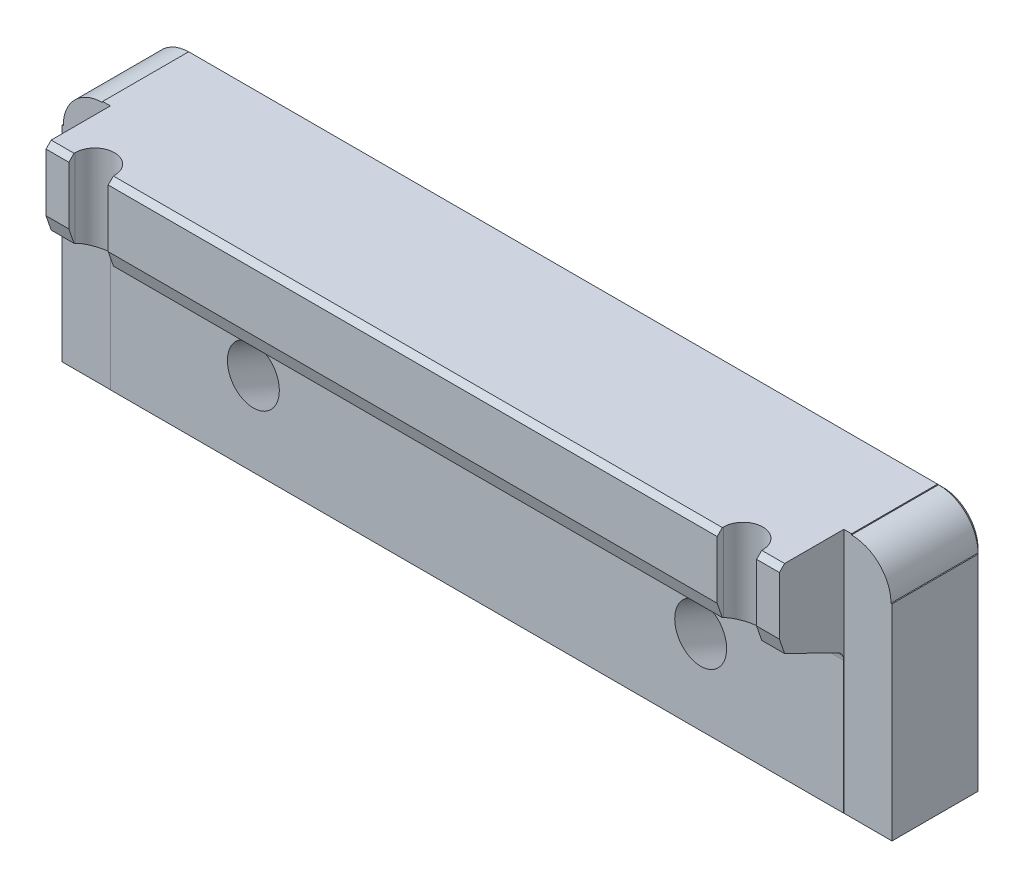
ISO-10303-21;
HEADER;
FILE_DESCRIPTION(('STEP AP214'),'2;1');
FILE_NAME('part.step','',(''),(''),'','','');
FILE_SCHEMA(('AUTOMOTIVE_DESIGN { 1 0 10303 214 1 1 1 1 }'));
ENDSEC;
DATA;
#1=APPLICATION_CONTEXT('core data for automotive mechanical design processes');
#2=APPLICATION_PROTOCOL_DEFINITION('international standard','automotive_design',2000,#1);
#3=PRODUCT_CONTEXT('',#1,'mechanical');
#4=PRODUCT('Part','Part','',(#3));
#5=PRODUCT_RELATED_PRODUCT_CATEGORY('part','',(#4));
#6=PRODUCT_DEFINITION_FORMATION('','',#4);
#7=PRODUCT_DEFINITION_CONTEXT('part definition',#1,'design');
#8=PRODUCT_DEFINITION('design','',#6,#7);
#9=PRODUCT_DEFINITION_SHAPE('','',#8);
#10=(LENGTH_UNIT() NAMED_UNIT(*) SI_UNIT(.MILLI.,.METRE.));
#11=(NAMED_UNIT(*) PLANE_ANGLE_UNIT() SI_UNIT($,.RADIAN.));
#12=(NAMED_UNIT(*) SI_UNIT($,.STERADIAN.) SOLID_ANGLE_UNIT());
#13=UNCERTAINTY_MEASURE_WITH_UNIT(LENGTH_MEASURE(1.E-05),#10,'distance_accuracy_value','');
#14=(GEOMETRIC_REPRESENTATION_CONTEXT(3) GLOBAL_UNCERTAINTY_ASSIGNED_CONTEXT((#13)) GLOBAL_UNIT_ASSIGNED_CONTEXT((#10,
#11,#12)) REPRESENTATION_CONTEXT('',''));
#15=CARTESIAN_POINT('',(0.,0.,0.));
#16=DIRECTION('',(0.,0.,1.));
#17=DIRECTION('',(1.,0.,0.));
#18=AXIS2_PLACEMENT_3D('',#15,#16,#17);
#19=CARTESIAN_POINT('',(101.5873,14.6876778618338,38.1));
#20=DIRECTION('',(0.,0.,-1.));
#21=DIRECTION('',(0.,1.,0.));
#22=AXIS2_PLACEMENT_3D('',#19,#20,#21);
#23=PLANE('',#22);
#24=DIRECTION('',(0.,-1.,0.));
#25=VECTOR('',#24,1.);
#26=CARTESIAN_POINT('',(-84.201,14.6876778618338,38.1));
#27=LINE('',#26,#25);
#28=CARTESIAN_POINT('',(-84.201,28.829,38.1));
#29=VERTEX_POINT('',#28);
#30=CARTESIAN_POINT('',(-84.201,14.6876778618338,38.1));
#31=VERTEX_POINT('',#30);
#32=EDGE_CURVE('E374',#29,#31,#27,.T.);
#33=ORIENTED_EDGE('',*,*,#32,.F.);
#34=DIRECTION('',(-1.,0.,0.));
#35=VECTOR('',#34,1.);
#36=CARTESIAN_POINT('',(101.5873,28.829,38.1));
#37=LINE('',#36,#35);
#38=CARTESIAN_POINT('',(-89.789,28.829,38.1));
#39=VERTEX_POINT('',#38);
#40=EDGE_CURVE('E557',#29,#39,#37,.T.);
#41=ORIENTED_EDGE('',*,*,#40,.T.);
#42=DIRECTION('',(0.,-1.,0.));
#43=VECTOR('',#42,1.);
#44=CARTESIAN_POINT('',(-89.789,38.3995230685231,38.1));
#45=LINE('',#44,#43);
#46=CARTESIAN_POINT('',(-89.789,14.6876778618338,38.1));
#47=VERTEX_POINT('',#46);
#48=EDGE_CURVE('E419',#39,#47,#45,.T.);
#49=ORIENTED_EDGE('',*,*,#48,.T.);
#50=DIRECTION('',(-1.,0.,0.));
#51=VECTOR('',#50,1.);
#52=CARTESIAN_POINT('',(101.5873,14.6876778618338,38.1));
#53=LINE('',#52,#51);
#54=EDGE_CURVE('E472',#31,#47,#53,.T.);
#55=ORIENTED_EDGE('',*,*,#54,.F.);
#56=EDGE_LOOP('',(#33,#41,#49,#55));
#57=FACE_BOUND('',#56,.T.);
#58=ADVANCED_FACE('F16',(#57),#23,.F.);
#59=DIRECTION('',(0.,1.,0.));
#60=VECTOR('',#59,1.);
#61=CARTESIAN_POINT('',(74.549,14.6876778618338,38.1));
#62=LINE('',#61,#60);
#63=CARTESIAN_POINT('',(74.549,14.6876778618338,38.1));
#64=VERTEX_POINT('',#63);
#65=CARTESIAN_POINT('',(74.549,28.829,38.1));
#66=VERTEX_POINT('',#65);
#67=EDGE_CURVE('E397',#64,#66,#62,.T.);
#68=ORIENTED_EDGE('',*,*,#67,.T.);
#69=DIRECTION('',(-1.,0.,0.));
#70=VECTOR('',#69,1.);
#71=CARTESIAN_POINT('',(101.5873,28.829,38.1));
#72=LINE('',#71,#70);
#73=CARTESIAN_POINT('',(-74.549,28.829,38.1));
#74=VERTEX_POINT('',#73);
#75=EDGE_CURVE('E550',#66,#74,#72,.T.);
#76=ORIENTED_EDGE('',*,*,#75,.T.);
#77=DIRECTION('',(0.,1.,0.));
#78=VECTOR('',#77,1.);
#79=CARTESIAN_POINT('',(-74.549,14.6876778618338,38.1));
#80=LINE('',#79,#78);
#81=CARTESIAN_POINT('',(-74.549,14.6876778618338,38.1));
#82=VERTEX_POINT('',#81);
#83=EDGE_CURVE('E369',#82,#74,#80,.T.);
#84=ORIENTED_EDGE('',*,*,#83,.F.);
#85=EDGE_CURVE('E478',#64,#82,#53,.T.);
#86=ORIENTED_EDGE('',*,*,#85,.F.);
#87=EDGE_LOOP('',(#68,#76,#84,#86));
#88=FACE_BOUND('',#87,.T.);
#89=ADVANCED_FACE('F726',(#88),#23,.F.);
#90=CARTESIAN_POINT('',(101.5873,10.9993300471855,36.83));
#91=DIRECTION('',(0.,0.325568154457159,-0.945518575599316));
#92=DIRECTION('',(0.,0.945518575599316,0.325568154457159));
#93=AXIS2_PLACEMENT_3D('',#90,#91,#92);
#94=PLANE('',#93);
#95=DIRECTION('',(0.,-0.945518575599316,-0.325568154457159));
#96=VECTOR('',#95,1.);
#97=CARTESIAN_POINT('',(-84.201,10.9993300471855,36.83));
#98=LINE('',#97,#96);
#99=CARTESIAN_POINT('',(-84.201,10.9993300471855,36.83));
#100=VERTEX_POINT('',#99);
#101=EDGE_CURVE('E372',#31,#100,#98,.T.);
#102=ORIENTED_EDGE('',*,*,#101,.F.);
#103=ORIENTED_EDGE('',*,*,#54,.T.);
#104=DIRECTION('',(0.,0.945518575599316,0.325568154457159));
#105=VECTOR('',#104,1.);
#106=CARTESIAN_POINT('',(-89.789,10.9993300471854,36.83));
#107=LINE('',#106,#105);
#108=CARTESIAN_POINT('',(-89.789,10.9993300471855,36.83));
#109=VERTEX_POINT('',#108);
#110=EDGE_CURVE('E454',#109,#47,#107,.T.);
#111=ORIENTED_EDGE('',*,*,#110,.F.);
#112=DIRECTION('',(-1.,0.,0.));
#113=VECTOR('',#112,1.);
#114=CARTESIAN_POINT('',(101.5873,10.9993300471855,36.83));
#115=LINE('',#114,#113);
#116=EDGE_CURVE('E468',#100,#109,#115,.T.);
#117=ORIENTED_EDGE('',*,*,#116,.F.);
#118=EDGE_LOOP('',(#102,#103,#111,#117));
#119=FACE_BOUND('',#118,.T.);
#120=ADVANCED_FACE('F732',(#119),#94,.F.);
#121=DIRECTION('',(0.,0.945518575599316,0.325568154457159));
#122=VECTOR('',#121,1.);
#123=CARTESIAN_POINT('',(-74.549,10.9993300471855,36.83));
#124=LINE('',#123,#122);
#125=CARTESIAN_POINT('',(-74.549,10.9993300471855,36.83));
#126=VERTEX_POINT('',#125);
#127=EDGE_CURVE('E366',#126,#82,#124,.T.);
#128=ORIENTED_EDGE('',*,*,#127,.F.);
#129=CARTESIAN_POINT('',(74.549,10.9993300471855,36.83));
#130=VERTEX_POINT('',#129);
#131=EDGE_CURVE('E473',#130,#126,#115,.T.);
#132=ORIENTED_EDGE('',*,*,#131,.F.);
#133=DIRECTION('',(0.,0.945518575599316,0.325568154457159));
#134=VECTOR('',#133,1.);
#135=CARTESIAN_POINT('',(74.549,10.9993300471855,36.83));
#136=LINE('',#135,#134);
#137=EDGE_CURVE('E394',#130,#64,#136,.T.);
#138=ORIENTED_EDGE('',*,*,#137,.T.);
#139=ORIENTED_EDGE('',*,*,#85,.T.);
#140=EDGE_LOOP('',(#128,#132,#138,#139));
#141=FACE_BOUND('',#140,.T.);
#142=ADVANCED_FACE('F742',(#141),#94,.F.);
#143=CARTESIAN_POINT('',(101.5873,30.099,38.1));
#144=DIRECTION('',(0.,-1.,0.));
#145=DIRECTION('',(0.,0.,-1.));
#146=AXIS2_PLACEMENT_3D('',#143,#144,#145);
#147=PLANE('',#146);
#148=DIRECTION('',(0.,0.,-1.));
#149=VECTOR('',#148,1.);
#150=CARTESIAN_POINT('',(84.201,30.099,36.576));
#151=LINE('',#150,#149);
#152=CARTESIAN_POINT('',(84.201,30.099,36.83));
#153=VERTEX_POINT('',#152);
#154=CARTESIAN_POINT('',(84.201,30.099,36.576));
#155=VERTEX_POINT('',#154);
#156=EDGE_CURVE('E376',#153,#155,#151,.T.);
#157=ORIENTED_EDGE('',*,*,#156,.F.);
#158=DIRECTION('',(1.,0.,0.));
#159=VECTOR('',#158,1.);
#160=CARTESIAN_POINT('',(101.5873,30.099,36.83));
#161=LINE('',#160,#159);
#162=CARTESIAN_POINT('',(89.789,30.099,36.83));
#163=VERTEX_POINT('',#162);
#164=EDGE_CURVE('E546',#153,#163,#161,.T.);
#165=ORIENTED_EDGE('',*,*,#164,.T.);
#166=DIRECTION('',(0.,0.,1.));
#167=VECTOR('',#166,1.);
#168=CARTESIAN_POINT('',(89.789,30.099,38.1));
#169=LINE('',#168,#167);
#170=CARTESIAN_POINT('',(89.789,30.099,22.3266));
#171=VERTEX_POINT('',#170);
#172=EDGE_CURVE('E446',#171,#163,#169,.T.);
#173=ORIENTED_EDGE('',*,*,#172,.F.);
#174=DIRECTION('',(-1.,0.,0.));
#175=VECTOR('',#174,1.);
#176=CARTESIAN_POINT('',(101.5873,30.099,22.3266));
#177=LINE('',#176,#175);
#178=CARTESIAN_POINT('',(91.6813,30.099,22.3266));
#179=VERTEX_POINT('',#178);
#180=EDGE_CURVE('E437',#179,#171,#177,.T.);
#181=ORIENTED_EDGE('',*,*,#180,.F.);
#182=DIRECTION('',(0.,0.,-1.));
#183=VECTOR('',#182,1.);
#184=CARTESIAN_POINT('',(91.6813,30.099,38.1));
#185=LINE('',#184,#183);
#186=CARTESIAN_POINT('',(91.6813,30.099,1.26999999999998));
#187=VERTEX_POINT('',#186);
#188=EDGE_CURVE('E412',#179,#187,#185,.T.);
#189=ORIENTED_EDGE('',*,*,#188,.T.);
#190=DIRECTION('',(-1.,0.,0.));
#191=VECTOR('',#190,1.);
#192=CARTESIAN_POINT('',(101.5873,30.099,1.26999999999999));
#193=LINE('',#192,#191);
#194=CARTESIAN_POINT('',(-91.6813,30.099,1.26999999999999));
#195=VERTEX_POINT('',#194);
#196=EDGE_CURVE('E539',#187,#195,#193,.T.);
#197=ORIENTED_EDGE('',*,*,#196,.T.);
#198=DIRECTION('',(0.,0.,-1.));
#199=VECTOR('',#198,1.);
#200=CARTESIAN_POINT('',(-91.6813,30.099,38.1));
#201=LINE('',#200,#199);
#202=CARTESIAN_POINT('',(-91.6813,30.099,22.3266));
#203=VERTEX_POINT('',#202);
#204=EDGE_CURVE('E406',#203,#195,#201,.T.);
#205=ORIENTED_EDGE('',*,*,#204,.F.);
#206=CARTESIAN_POINT('',(-89.789,30.099,22.3266));
#207=VERTEX_POINT('',#206);
#208=EDGE_CURVE('E432',#207,#203,#177,.T.);
#209=ORIENTED_EDGE('',*,*,#208,.F.);
#210=DIRECTION('',(0.,0.,-1.));
#211=VECTOR('',#210,1.);
#212=CARTESIAN_POINT('',(-89.789,30.099,38.1));
#213=LINE('',#212,#211);
#214=CARTESIAN_POINT('',(-89.789,30.099,36.83));
#215=VERTEX_POINT('',#214);
#216=EDGE_CURVE('E457',#215,#207,#213,.T.);
#217=ORIENTED_EDGE('',*,*,#216,.F.);
#218=DIRECTION('',(1.,0.,0.));
#219=VECTOR('',#218,1.);
#220=CARTESIAN_POINT('',(101.5873,30.099,36.83));
#221=LINE('',#220,#219);
#222=CARTESIAN_POINT('',(-84.201,30.099,36.83));
#223=VERTEX_POINT('',#222);
#224=EDGE_CURVE('E542',#215,#223,#221,.T.);
#225=ORIENTED_EDGE('',*,*,#224,.T.);
#226=DIRECTION('',(0.,0.,-1.));
#227=VECTOR('',#226,1.);
#228=CARTESIAN_POINT('',(-84.201,30.099,36.576));
#229=LINE('',#228,#227);
#230=CARTESIAN_POINT('',(-84.201,30.099,36.576));
#231=VERTEX_POINT('',#230);
#232=EDGE_CURVE('E360',#223,#231,#229,.T.);
#233=ORIENTED_EDGE('',*,*,#232,.T.);
#234=CARTESIAN_POINT('',(-79.375,30.099,36.576));
#235=DIRECTION('',(0.,-1.,0.));
#236=DIRECTION('',(0.,0.,-1.));
#237=AXIS2_PLACEMENT_3D('',#234,#235,#236);
#238=CIRCLE('',#237,4.826);
#239=CARTESIAN_POINT('',(-74.549,30.099,36.576));
#240=VERTEX_POINT('',#239);
#241=EDGE_CURVE('E356',#231,#240,#238,.T.);
#242=ORIENTED_EDGE('',*,*,#241,.T.);
#243=DIRECTION('',(0.,0.,1.));
#244=VECTOR('',#243,1.);
#245=CARTESIAN_POINT('',(-74.549,30.099,56.3881036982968));
#246=LINE('',#245,#244);
#247=CARTESIAN_POINT('',(-74.549,30.099,36.83));
#248=VERTEX_POINT('',#247);
#249=EDGE_CURVE('E353',#240,#248,#246,.T.);
#250=ORIENTED_EDGE('',*,*,#249,.T.);
#251=DIRECTION('',(1.,0.,0.));
#252=VECTOR('',#251,1.);
#253=CARTESIAN_POINT('',(101.5873,30.099,36.83));
#254=LINE('',#253,#252);
#255=CARTESIAN_POINT('',(74.549,30.099,36.83));
#256=VERTEX_POINT('',#255);
#257=EDGE_CURVE('E544',#248,#256,#254,.T.);
#258=ORIENTED_EDGE('',*,*,#257,.T.);
#259=DIRECTION('',(0.,0.,1.));
#260=VECTOR('',#259,1.);
#261=CARTESIAN_POINT('',(74.549,30.099,56.3881036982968));
#262=LINE('',#261,#260);
#263=CARTESIAN_POINT('',(74.549,30.099,36.576));
#264=VERTEX_POINT('',#263);
#265=EDGE_CURVE('E381',#264,#256,#262,.T.);
#266=ORIENTED_EDGE('',*,*,#265,.F.);
#267=CARTESIAN_POINT('',(79.375,30.099,36.576));
#268=DIRECTION('',(0.,1.,0.));
#269=DIRECTION('',(0.,0.,-1.));
#270=AXIS2_PLACEMENT_3D('',#267,#268,#269);
#271=CIRCLE('',#270,4.826);
#272=EDGE_CURVE('E378',#155,#264,#271,.T.);
#273=ORIENTED_EDGE('',*,*,#272,.F.);
#274=EDGE_LOOP('',(#157,#165,#173,#181,#189,#197,#205,#209,#217,#225,#233,#242,#250,#258,#266,#273));
#275=FACE_BOUND('',#274,.T.);
#276=ADVANCED_FACE('F659',(#275),#147,.F.);
#277=CARTESIAN_POINT('',(101.5873,3.93793762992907,22.352));
#278=DIRECTION('',(0.,0.89879404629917,-0.438371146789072));
#279=DIRECTION('',(0.,0.438371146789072,0.89879404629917));
#280=AXIS2_PLACEMENT_3D('',#277,#278,#279);
#281=PLANE('',#280);
#282=DIRECTION('',(0.,0.438371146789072,0.89879404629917));
#283=VECTOR('',#282,1.);
#284=CARTESIAN_POINT('',(-89.789,3.93793762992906,22.352));
#285=LINE('',#284,#283);
#286=CARTESIAN_POINT('',(-89.789,4.63370635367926,23.7785372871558));
#287=VERTEX_POINT('',#286);
#288=EDGE_CURVE('E452',#287,#109,#285,.T.);
#289=ORIENTED_EDGE('',*,*,#288,.F.);
#290=DIRECTION('',(-1.,0.,0.));
#291=VECTOR('',#290,1.);
#292=CARTESIAN_POINT('',(89.789,4.63370635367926,23.7785372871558));
#293=LINE('',#292,#291);
#294=CARTESIAN_POINT('',(89.789,4.63370635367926,23.7785372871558));
#295=VERTEX_POINT('',#294);
#296=EDGE_CURVE('E520',#287,#295,#293,.F.);
#297=ORIENTED_EDGE('',*,*,#296,.T.);
#298=DIRECTION('',(0.,-0.438371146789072,-0.89879404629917));
#299=VECTOR('',#298,1.);
#300=CARTESIAN_POINT('',(89.789,3.93793762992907,22.352));
#301=LINE('',#300,#299);
#302=CARTESIAN_POINT('',(89.789,10.9993300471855,36.83));
#303=VERTEX_POINT('',#302);
#304=EDGE_CURVE('E441',#303,#295,#301,.T.);
#305=ORIENTED_EDGE('',*,*,#304,.F.);
#306=CARTESIAN_POINT('',(84.201,10.9993300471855,36.83));
#307=VERTEX_POINT('',#306);
#308=EDGE_CURVE('E469',#303,#307,#115,.T.);
#309=ORIENTED_EDGE('',*,*,#308,.T.);
#310=DIRECTION('',(0.,-0.438371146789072,-0.89879404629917));
#311=VECTOR('',#310,1.);
#312=CARTESIAN_POINT('',(84.201,3.93793762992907,22.352));
#313=LINE('',#312,#311);
#314=CARTESIAN_POINT('',(84.201,10.8754459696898,36.576));
#315=VERTEX_POINT('',#314);
#316=EDGE_CURVE('E501',#307,#315,#313,.T.);
#317=ORIENTED_EDGE('',*,*,#316,.T.);
#318=CARTESIAN_POINT('',(79.375,10.8754459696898,36.576));
#319=DIRECTION('',(0.,0.89879404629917,-0.438371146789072));
#320=DIRECTION('',(0.,0.438371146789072,0.89879404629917));
#321=AXIS2_PLACEMENT_3D('',#318,#319,#320);
#322=ELLIPSE('',#321,5.36941696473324,4.826);
#323=CARTESIAN_POINT('',(74.549,10.8754459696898,36.576));
#324=VERTEX_POINT('',#323);
#325=EDGE_CURVE('E504',#315,#324,#322,.T.);
#326=ORIENTED_EDGE('',*,*,#325,.T.);
#327=DIRECTION('',(0.,0.438371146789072,0.89879404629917));
#328=VECTOR('',#327,1.);
#329=CARTESIAN_POINT('',(74.549,3.93793762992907,22.352));
#330=LINE('',#329,#328);
#331=EDGE_CURVE('E507',#324,#130,#330,.T.);
#332=ORIENTED_EDGE('',*,*,#331,.T.);
#333=ORIENTED_EDGE('',*,*,#131,.T.);
#334=DIRECTION('',(0.,0.438371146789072,0.89879404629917));
#335=VECTOR('',#334,1.);
#336=CARTESIAN_POINT('',(-74.549,3.93793762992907,22.352));
#337=LINE('',#336,#335);
#338=CARTESIAN_POINT('',(-74.549,10.8754459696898,36.576));
#339=VERTEX_POINT('',#338);
#340=EDGE_CURVE('E510',#339,#126,#337,.T.);
#341=ORIENTED_EDGE('',*,*,#340,.F.);
#342=CARTESIAN_POINT('',(-79.375,10.8754459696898,36.576));
#343=DIRECTION('',(0.,0.89879404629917,-0.438371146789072));
#344=DIRECTION('',(0.,0.438371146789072,0.89879404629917));
#345=AXIS2_PLACEMENT_3D('',#342,#343,#344);
#346=ELLIPSE('',#345,5.36941696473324,4.826);
#347=CARTESIAN_POINT('',(-84.201,10.8754459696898,36.576));
#348=VERTEX_POINT('',#347);
#349=EDGE_CURVE('E512',#348,#339,#346,.F.);
#350=ORIENTED_EDGE('',*,*,#349,.F.);
#351=DIRECTION('',(0.,-0.438371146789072,-0.89879404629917));
#352=VECTOR('',#351,1.);
#353=CARTESIAN_POINT('',(-84.201,3.93793762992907,22.352));
#354=LINE('',#353,#352);
#355=EDGE_CURVE('E515',#100,#348,#354,.T.);
#356=ORIENTED_EDGE('',*,*,#355,.F.);
#357=ORIENTED_EDGE('',*,*,#116,.T.);
#358=EDGE_LOOP('',(#289,#297,#305,#309,#317,#326,#332,#333,#341,#350,#356,#357));
#359=FACE_BOUND('',#358,.T.);
#360=ADVANCED_FACE('F677',(#359),#281,.F.);
#361=CARTESIAN_POINT('',(-101.5873,30.099,22.352));
#362=DIRECTION('',(1.,0.,0.));
#363=DIRECTION('',(0.,0.,-1.));
#364=AXIS2_PLACEMENT_3D('',#361,#362,#363);
#365=PLANE('',#364);
#366=DIRECTION('',(0.,0.,1.));
#367=VECTOR('',#366,1.);
#368=CARTESIAN_POINT('',(-101.5873,20.193,22.352));
#369=LINE('',#368,#367);
#370=CARTESIAN_POINT('',(-101.5873,20.193,1.26999999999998));
#371=VERTEX_POINT('',#370);
#372=CARTESIAN_POINT('',(-101.5873,20.193,22.3266));
#373=VERTEX_POINT('',#372);
#374=EDGE_CURVE('E403',#371,#373,#369,.T.);
#375=ORIENTED_EDGE('',*,*,#374,.F.);
#376=DIRECTION('',(0.,-1.,0.));
#377=VECTOR('',#376,1.);
#378=CARTESIAN_POINT('',(-101.5873,30.099,1.26999999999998));
#379=LINE('',#378,#377);
#380=CARTESIAN_POINT('',(-101.5873,-30.099,1.26999999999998));
#381=VERTEX_POINT('',#380);
#382=EDGE_CURVE('E580',#371,#381,#379,.T.);
#383=ORIENTED_EDGE('',*,*,#382,.T.);
#384=DIRECTION('',(0.,0.,-1.));
#385=VECTOR('',#384,1.);
#386=CARTESIAN_POINT('',(-101.5873,-30.099,0.));
#387=LINE('',#386,#385);
#388=CARTESIAN_POINT('',(-101.5873,-30.099,22.3266));
#389=VERTEX_POINT('',#388);
#390=EDGE_CURVE('E459',#389,#381,#387,.T.);
#391=ORIENTED_EDGE('',*,*,#390,.F.);
#392=DIRECTION('',(0.,-1.,0.));
#393=VECTOR('',#392,1.);
#394=CARTESIAN_POINT('',(-101.5873,30.099,22.3266));
#395=LINE('',#394,#393);
#396=EDGE_CURVE('E477',#373,#389,#395,.T.);
#397=ORIENTED_EDGE('',*,*,#396,.F.);
#398=EDGE_LOOP('',(#375,#383,#391,#397));
#399=FACE_BOUND('',#398,.T.);
#400=ADVANCED_FACE('F619',(#399),#365,.F.);
#401=CARTESIAN_POINT('',(101.5873,30.099,0.));
#402=DIRECTION('',(0.,0.,1.));
#403=DIRECTION('',(1.,0.,0.));
#404=AXIS2_PLACEMENT_3D('',#401,#402,#403);
#405=PLANE('',#404);
#406=CARTESIAN_POINT('',(83.82,-19.812,0.));
#407=DIRECTION('',(0.,0.,-1.));
#408=DIRECTION('',(-1.,0.,0.));
#409=AXIS2_PLACEMENT_3D('',#406,#407,#408);
#410=CIRCLE('',#409,3.96875);
#411=CARTESIAN_POINT('',(79.85125,-19.812,0.));
#412=VERTEX_POINT('',#411);
#413=EDGE_CURVE('E275',#412,#412,#410,.T.);
#414=ORIENTED_EDGE('',*,*,#413,.F.);
#415=EDGE_LOOP('',(#414));
#416=FACE_BOUND('',#415,.T.);
#417=CARTESIAN_POINT('',(83.82,19.812,0.));
#418=DIRECTION('',(0.,0.,-1.));
#419=DIRECTION('',(-1.,0.,0.));
#420=AXIS2_PLACEMENT_3D('',#417,#418,#419);
#421=CIRCLE('',#420,3.96875);
#422=CARTESIAN_POINT('',(79.85125,19.812,0.));
#423=VERTEX_POINT('',#422);
#424=EDGE_CURVE('E287',#423,#423,#421,.T.);
#425=ORIENTED_EDGE('',*,*,#424,.F.);
#426=EDGE_LOOP('',(#425));
#427=FACE_BOUND('',#426,.T.);
#428=CARTESIAN_POINT('',(0.,19.812,0.));
#429=DIRECTION('',(0.,0.,-1.));
#430=DIRECTION('',(-1.,0.,0.));
#431=AXIS2_PLACEMENT_3D('',#428,#429,#430);
#432=CIRCLE('',#431,3.96875);
#433=CARTESIAN_POINT('',(-3.96875,19.812,0.));
#434=VERTEX_POINT('',#433);
#435=EDGE_CURVE('E299',#434,#434,#432,.T.);
#436=ORIENTED_EDGE('',*,*,#435,.F.);
#437=EDGE_LOOP('',(#436));
#438=FACE_BOUND('',#437,.T.);
#439=CARTESIAN_POINT('',(0.,-19.812,0.));
#440=DIRECTION('',(0.,0.,-1.));
#441=DIRECTION('',(-1.,0.,0.));
#442=AXIS2_PLACEMENT_3D('',#439,#440,#441);
#443=CIRCLE('',#442,3.96875);
#444=CARTESIAN_POINT('',(-3.96875,-19.812,0.));
#445=VERTEX_POINT('',#444);
#446=EDGE_CURVE('E311',#445,#445,#443,.T.);
#447=ORIENTED_EDGE('',*,*,#446,.F.);
#448=EDGE_LOOP('',(#447));
#449=FACE_BOUND('',#448,.T.);
#450=CARTESIAN_POINT('',(-83.82,-19.812,0.));
#451=DIRECTION('',(0.,0.,-1.));
#452=DIRECTION('',(-1.,0.,0.));
#453=AXIS2_PLACEMENT_3D('',#450,#451,#452);
#454=CIRCLE('',#453,3.96875);
#455=CARTESIAN_POINT('',(-87.78875,-19.812,0.));
#456=VERTEX_POINT('',#455);
#457=EDGE_CURVE('E323',#456,#456,#454,.T.);
#458=ORIENTED_EDGE('',*,*,#457,.F.);
#459=EDGE_LOOP('',(#458));
#460=FACE_BOUND('',#459,.T.);
#461=CARTESIAN_POINT('',(-83.82,19.812,0.));
#462=DIRECTION('',(0.,0.,-1.));
#463=DIRECTION('',(-1.,0.,0.));
#464=AXIS2_PLACEMENT_3D('',#461,#462,#463);
#465=CIRCLE('',#464,3.96875);
#466=CARTESIAN_POINT('',(-87.78875,19.812,0.));
#467=VERTEX_POINT('',#466);
#468=EDGE_CURVE('E335',#467,#467,#465,.T.);
#469=ORIENTED_EDGE('',*,*,#468,.F.);
#470=EDGE_LOOP('',(#469));
#471=FACE_BOUND('',#470,.T.);
#472=CARTESIAN_POINT('',(-54.7624,-19.0246,0.));
#473=DIRECTION('',(0.,0.,1.));
#474=DIRECTION('',(0.,-1.,0.));
#475=AXIS2_PLACEMENT_3D('',#472,#473,#474);
#476=ELLIPSE('',#475,9.51977598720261,8.763);
#477=CARTESIAN_POINT('',(-54.7624,-28.5443759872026,0.));
#478=VERTEX_POINT('',#477);
#479=EDGE_CURVE('E349',#478,#478,#476,.T.);
#480=ORIENTED_EDGE('',*,*,#479,.T.);
#481=EDGE_LOOP('',(#480));
#482=FACE_BOUND('',#481,.T.);
#483=CARTESIAN_POINT('',(54.7624,-19.0246,0.));
#484=DIRECTION('',(0.,0.,1.));
#485=DIRECTION('',(0.,-1.,0.));
#486=AXIS2_PLACEMENT_3D('',#483,#484,#485);
#487=ELLIPSE('',#486,9.51977598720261,8.763);
#488=CARTESIAN_POINT('',(54.7624,-28.5443759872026,0.));
#489=VERTEX_POINT('',#488);
#490=EDGE_CURVE('E357',#489,#489,#487,.T.);
#491=ORIENTED_EDGE('',*,*,#490,.T.);
#492=EDGE_LOOP('',(#491));
#493=FACE_BOUND('',#492,.T.);
#494=DIRECTION('',(1.,0.,0.));
#495=VECTOR('',#494,1.);
#496=CARTESIAN_POINT('',(101.5873,28.829,0.));
#497=LINE('',#496,#495);
#498=CARTESIAN_POINT('',(-91.6813,28.829,0.));
#499=VERTEX_POINT('',#498);
#500=CARTESIAN_POINT('',(91.6813,28.829,0.));
#501=VERTEX_POINT('',#500);
#502=EDGE_CURVE('E573',#499,#501,#497,.T.);
#503=ORIENTED_EDGE('',*,*,#502,.T.);
#504=CARTESIAN_POINT('',(91.6813,20.193,0.));
#505=DIRECTION('',(0.,0.,1.));
#506=DIRECTION('',(1.,0.,0.));
#507=AXIS2_PLACEMENT_3D('',#504,#505,#506);
#508=CIRCLE('',#507,8.636);
#509=CARTESIAN_POINT('',(100.3173,20.193,0.));
#510=VERTEX_POINT('',#509);
#511=EDGE_CURVE('E593',#501,#510,#508,.F.);
#512=ORIENTED_EDGE('',*,*,#511,.T.);
#513=DIRECTION('',(0.,-1.,0.));
#514=VECTOR('',#513,1.);
#515=CARTESIAN_POINT('',(100.3173,-30.099,0.));
#516=LINE('',#515,#514);
#517=CARTESIAN_POINT('',(100.3173,-28.829,0.));
#518=VERTEX_POINT('',#517);
#519=EDGE_CURVE('E567',#510,#518,#516,.T.);
#520=ORIENTED_EDGE('',*,*,#519,.T.);
#521=DIRECTION('',(-1.,0.,0.));
#522=VECTOR('',#521,1.);
#523=CARTESIAN_POINT('',(101.5873,-28.829,0.));
#524=LINE('',#523,#522);
#525=CARTESIAN_POINT('',(-100.3173,-28.829,0.));
#526=VERTEX_POINT('',#525);
#527=EDGE_CURVE('E569',#518,#526,#524,.T.);
#528=ORIENTED_EDGE('',*,*,#527,.T.);
#529=DIRECTION('',(0.,1.,0.));
#530=VECTOR('',#529,1.);
#531=CARTESIAN_POINT('',(-100.3173,30.099,0.));
#532=LINE('',#531,#530);
#533=CARTESIAN_POINT('',(-100.3173,20.193,0.));
#534=VERTEX_POINT('',#533);
#535=EDGE_CURVE('E571',#526,#534,#532,.T.);
#536=ORIENTED_EDGE('',*,*,#535,.T.);
#537=CARTESIAN_POINT('',(-91.6813,20.193,0.));
#538=DIRECTION('',(0.,0.,1.));
#539=DIRECTION('',(1.,0.,0.));
#540=AXIS2_PLACEMENT_3D('',#537,#538,#539);
#541=CIRCLE('',#540,8.636);
#542=EDGE_CURVE('E589',#534,#499,#541,.F.);
#543=ORIENTED_EDGE('',*,*,#542,.T.);
#544=EDGE_LOOP('',(#503,#512,#520,#528,#536,#543));
#545=FACE_BOUND('',#544,.T.);
#546=ADVANCED_FACE('F707',(#416,#427,#438,#449,#460,#471,#482,#493,#545),#405,.F.);
#547=CARTESIAN_POINT('',(0.,-9.82235179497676,22.3266));
#548=DIRECTION('',(0.,0.,1.));
#549=DIRECTION('',(1.,0.,0.));
#550=AXIS2_PLACEMENT_3D('',#547,#548,#549);
#551=PLANE('',#550);
#552=ORIENTED_EDGE('',*,*,#208,.T.);
#553=DIRECTION('',(0.,-1.,0.));
#554=VECTOR('',#553,1.);
#555=CARTESIAN_POINT('',(-91.6813,-9.82235179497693,22.3266));
#556=LINE('',#555,#554);
#557=CARTESIAN_POINT('',(-91.6813,29.845,22.3266));
#558=VERTEX_POINT('',#557);
#559=EDGE_CURVE('E498',#203,#558,#556,.T.);
#560=ORIENTED_EDGE('',*,*,#559,.T.);
#561=CARTESIAN_POINT('',(-91.6813,20.193,22.3266));
#562=DIRECTION('',(0.,0.,1.));
#563=DIRECTION('',(1.,0.,0.));
#564=AXIS2_PLACEMENT_3D('',#561,#562,#563);
#565=CIRCLE('',#564,9.652);
#566=CARTESIAN_POINT('',(-101.3333,20.193,22.3266));
#567=VERTEX_POINT('',#566);
#568=EDGE_CURVE('E495',#558,#567,#565,.T.);
#569=ORIENTED_EDGE('',*,*,#568,.T.);
#570=DIRECTION('',(-1.,0.,0.));
#571=VECTOR('',#570,1.);
#572=CARTESIAN_POINT('',(0.,20.193,22.3266));
#573=LINE('',#572,#571);
#574=EDGE_CURVE('E492',#567,#373,#573,.T.);
#575=ORIENTED_EDGE('',*,*,#574,.T.);
#576=ORIENTED_EDGE('',*,*,#396,.T.);
#577=DIRECTION('',(1.,0.,0.));
#578=VECTOR('',#577,1.);
#579=CARTESIAN_POINT('',(101.5873,-30.099,22.3266));
#580=LINE('',#579,#578);
#581=CARTESIAN_POINT('',(-89.789,-30.099,22.3266));
#582=VERTEX_POINT('',#581);
#583=EDGE_CURVE('E430',#389,#582,#580,.T.);
#584=ORIENTED_EDGE('',*,*,#583,.T.);
#585=DIRECTION('',(0.,-1.,0.));
#586=VECTOR('',#585,1.);
#587=CARTESIAN_POINT('',(-89.789,38.3995230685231,22.3266));
#588=LINE('',#587,#586);
#589=EDGE_CURVE('E424',#207,#582,#588,.T.);
#590=ORIENTED_EDGE('',*,*,#589,.F.);
#591=EDGE_LOOP('',(#552,#560,#569,#575,#576,#584,#590));
#592=FACE_BOUND('',#591,.T.);
#593=ADVANCED_FACE('F695',(#592),#551,.T.);
#594=DIRECTION('',(0.,1.,0.));
#595=VECTOR('',#594,1.);
#596=CARTESIAN_POINT('',(89.789,38.3995230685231,38.1));
#597=LINE('',#596,#595);
#598=CARTESIAN_POINT('',(89.789,14.6876778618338,38.1));
#599=VERTEX_POINT('',#598);
#600=CARTESIAN_POINT('',(89.789,28.829,38.1));
#601=VERTEX_POINT('',#600);
#602=EDGE_CURVE('E421',#599,#601,#597,.T.);
#603=ORIENTED_EDGE('',*,*,#602,.T.);
#604=DIRECTION('',(-1.,0.,0.));
#605=VECTOR('',#604,1.);
#606=CARTESIAN_POINT('',(101.5873,28.829,38.1));
#607=LINE('',#606,#605);
#608=CARTESIAN_POINT('',(84.201,28.829,38.1));
#609=VERTEX_POINT('',#608);
#610=EDGE_CURVE('E526',#601,#609,#607,.T.);
#611=ORIENTED_EDGE('',*,*,#610,.T.);
#612=DIRECTION('',(0.,-1.,0.));
#613=VECTOR('',#612,1.);
#614=CARTESIAN_POINT('',(84.201,14.6876778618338,38.1));
#615=LINE('',#614,#613);
#616=CARTESIAN_POINT('',(84.201,14.6876778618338,38.1));
#617=VERTEX_POINT('',#616);
#618=EDGE_CURVE('E392',#609,#617,#615,.T.);
#619=ORIENTED_EDGE('',*,*,#618,.T.);
#620=EDGE_CURVE('E474',#599,#617,#53,.T.);
#621=ORIENTED_EDGE('',*,*,#620,.F.);
#622=EDGE_LOOP('',(#603,#611,#619,#621));
#623=FACE_BOUND('',#622,.T.);
#624=ADVANCED_FACE('F667',(#623),#23,.F.);
#625=ORIENTED_EDGE('',*,*,#620,.T.);
#626=DIRECTION('',(0.,-0.945518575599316,-0.325568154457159));
#627=VECTOR('',#626,1.);
#628=CARTESIAN_POINT('',(84.201,10.9993300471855,36.83));
#629=LINE('',#628,#627);
#630=EDGE_CURVE('E387',#617,#307,#629,.T.);
#631=ORIENTED_EDGE('',*,*,#630,.T.);
#632=ORIENTED_EDGE('',*,*,#308,.F.);
#633=DIRECTION('',(0.,-0.945518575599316,-0.325568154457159));
#634=VECTOR('',#633,1.);
#635=CARTESIAN_POINT('',(89.789,10.9993300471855,36.83));
#636=LINE('',#635,#634);
#637=EDGE_CURVE('E444',#599,#303,#636,.T.);
#638=ORIENTED_EDGE('',*,*,#637,.F.);
#639=EDGE_LOOP('',(#625,#631,#632,#638));
#640=FACE_BOUND('',#639,.T.);
#641=ADVANCED_FACE('F671',(#640),#94,.F.);
#642=CARTESIAN_POINT('',(101.5873,-30.099,22.352));
#643=DIRECTION('',(0.,0.,-1.));
#644=DIRECTION('',(0.,1.,0.));
#645=AXIS2_PLACEMENT_3D('',#642,#643,#644);
#646=PLANE('',#645);
#647=CARTESIAN_POINT('',(-54.7624,-9.5367389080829,22.352));
#648=DIRECTION('',(0.,0.,-1.));
#649=DIRECTION('',(0.,-1.,0.));
#650=AXIS2_PLACEMENT_3D('',#647,#648,#649);
#651=ELLIPSE('',#650,6.90528678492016,6.35635);
#652=CARTESIAN_POINT('',(-54.7624,-16.4420256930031,22.352));
#653=VERTEX_POINT('',#652);
#654=EDGE_CURVE('E344',#653,#653,#651,.T.);
#655=ORIENTED_EDGE('',*,*,#654,.T.);
#656=EDGE_LOOP('',(#655));
#657=FACE_BOUND('',#656,.T.);
#658=CARTESIAN_POINT('',(54.7624,-9.5367389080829,22.352));
#659=DIRECTION('',(0.,0.,-1.));
#660=DIRECTION('',(0.,-1.,0.));
#661=AXIS2_PLACEMENT_3D('',#658,#659,#660);
#662=ELLIPSE('',#661,6.90528678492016,6.35635);
#663=CARTESIAN_POINT('',(54.7624,-16.4420256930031,22.352));
#664=VERTEX_POINT('',#663);
#665=EDGE_CURVE('E352',#664,#664,#662,.T.);
#666=ORIENTED_EDGE('',*,*,#665,.T.);
#667=EDGE_LOOP('',(#666));
#668=FACE_BOUND('',#667,.T.);
#669=DIRECTION('',(0.,-1.,0.));
#670=VECTOR('',#669,1.);
#671=CARTESIAN_POINT('',(89.789,-30.099,22.352));
#672=LINE('',#671,#670);
#673=CARTESIAN_POINT('',(89.789,2.35076947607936,22.352));
#674=VERTEX_POINT('',#673);
#675=CARTESIAN_POINT('',(89.789,-30.099,22.352));
#676=VERTEX_POINT('',#675);
#677=EDGE_CURVE('E439',#674,#676,#672,.T.);
#678=ORIENTED_EDGE('',*,*,#677,.F.);
#679=DIRECTION('',(-1.,0.,0.));
#680=VECTOR('',#679,1.);
#681=CARTESIAN_POINT('',(-89.789,2.35076947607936,22.352));
#682=LINE('',#681,#680);
#683=CARTESIAN_POINT('',(-89.789,2.35076947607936,22.352));
#684=VERTEX_POINT('',#683);
#685=EDGE_CURVE('E517',#674,#684,#682,.T.);
#686=ORIENTED_EDGE('',*,*,#685,.T.);
#687=DIRECTION('',(0.,1.,0.));
#688=VECTOR('',#687,1.);
#689=CARTESIAN_POINT('',(-89.789,-30.099,22.352));
#690=LINE('',#689,#688);
#691=CARTESIAN_POINT('',(-89.789,-30.099,22.352));
#692=VERTEX_POINT('',#691);
#693=EDGE_CURVE('E449',#692,#684,#690,.T.);
#694=ORIENTED_EDGE('',*,*,#693,.F.);
#695=DIRECTION('',(-1.,0.,0.));
#696=VECTOR('',#695,1.);
#697=CARTESIAN_POINT('',(101.5873,-30.099,22.352));
#698=LINE('',#697,#696);
#699=EDGE_CURVE('E463',#676,#692,#698,.T.);
#700=ORIENTED_EDGE('',*,*,#699,.F.);
#701=EDGE_LOOP('',(#678,#686,#694,#700));
#702=FACE_BOUND('',#701,.T.);
#703=ADVANCED_FACE('F686',(#657,#668,#702),#646,.F.);
#704=CARTESIAN_POINT('',(101.5873,-30.099,0.));
#705=DIRECTION('',(0.,1.,0.));
#706=DIRECTION('',(0.,0.,1.));
#707=AXIS2_PLACEMENT_3D('',#704,#705,#706);
#708=PLANE('',#707);
#709=ORIENTED_EDGE('',*,*,#390,.T.);
#710=DIRECTION('',(1.,0.,0.));
#711=VECTOR('',#710,1.);
#712=CARTESIAN_POINT('',(101.5873,-30.099,1.26999999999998));
#713=LINE('',#712,#711);
#714=CARTESIAN_POINT('',(101.5873,-30.099,1.26999999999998));
#715=VERTEX_POINT('',#714);
#716=EDGE_CURVE('E582',#381,#715,#713,.T.);
#717=ORIENTED_EDGE('',*,*,#716,.T.);
#718=DIRECTION('',(0.,0.,-1.));
#719=VECTOR('',#718,1.);
#720=CARTESIAN_POINT('',(101.5873,-30.099,0.));
#721=LINE('',#720,#719);
#722=CARTESIAN_POINT('',(101.5873,-30.099,22.3266));
#723=VERTEX_POINT('',#722);
#724=EDGE_CURVE('E460',#723,#715,#721,.T.);
#725=ORIENTED_EDGE('',*,*,#724,.F.);
#726=CARTESIAN_POINT('',(89.789,-30.099,22.3266));
#727=VERTEX_POINT('',#726);
#728=EDGE_CURVE('E433',#727,#723,#580,.T.);
#729=ORIENTED_EDGE('',*,*,#728,.F.);
#730=DIRECTION('',(0.,0.,-1.));
#731=VECTOR('',#730,1.);
#732=CARTESIAN_POINT('',(89.789,-30.099,0.));
#733=LINE('',#732,#731);
#734=EDGE_CURVE('E480',#676,#727,#733,.T.);
#735=ORIENTED_EDGE('',*,*,#734,.F.);
#736=ORIENTED_EDGE('',*,*,#699,.T.);
#737=DIRECTION('',(0.,0.,1.));
#738=VECTOR('',#737,1.);
#739=CARTESIAN_POINT('',(-89.789,-30.099,0.));
#740=LINE('',#739,#738);
#741=EDGE_CURVE('E482',#582,#692,#740,.T.);
#742=ORIENTED_EDGE('',*,*,#741,.F.);
#743=ORIENTED_EDGE('',*,*,#583,.F.);
#744=EDGE_LOOP('',(#709,#717,#725,#729,#735,#736,#742,#743));
#745=FACE_BOUND('',#744,.T.);
#746=ADVANCED_FACE('F624',(#745),#708,.F.);
#747=CARTESIAN_POINT('',(101.5873,30.099,22.352));
#748=DIRECTION('',(1.,0.,0.));
#749=DIRECTION('',(0.,0.,-1.));
#750=AXIS2_PLACEMENT_3D('',#747,#748,#749);
#751=PLANE('',#750);
#752=ORIENTED_EDGE('',*,*,#724,.T.);
#753=DIRECTION('',(0.,1.,0.));
#754=VECTOR('',#753,1.);
#755=CARTESIAN_POINT('',(101.5873,20.193,1.26999999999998));
#756=LINE('',#755,#754);
#757=CARTESIAN_POINT('',(101.5873,20.193,1.27));
#758=VERTEX_POINT('',#757);
#759=EDGE_CURVE('E584',#715,#758,#756,.T.);
#760=ORIENTED_EDGE('',*,*,#759,.T.);
#761=DIRECTION('',(0.,0.,-1.));
#762=VECTOR('',#761,1.);
#763=CARTESIAN_POINT('',(101.5873,20.193,22.352));
#764=LINE('',#763,#762);
#765=CARTESIAN_POINT('',(101.5873,20.193,22.3266));
#766=VERTEX_POINT('',#765);
#767=EDGE_CURVE('E416',#766,#758,#764,.T.);
#768=ORIENTED_EDGE('',*,*,#767,.F.);
#769=DIRECTION('',(0.,-1.,0.));
#770=VECTOR('',#769,1.);
#771=CARTESIAN_POINT('',(101.5873,30.099,22.3266));
#772=LINE('',#771,#770);
#773=EDGE_CURVE('E436',#766,#723,#772,.T.);
#774=ORIENTED_EDGE('',*,*,#773,.T.);
#775=EDGE_LOOP('',(#752,#760,#768,#774));
#776=FACE_BOUND('',#775,.T.);
#777=ADVANCED_FACE('F638',(#776),#751,.T.);
#778=CARTESIAN_POINT('',(-89.789,38.3995230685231,22.3266));
#779=DIRECTION('',(-1.,0.,0.));
#780=DIRECTION('',(0.,-1.,0.));
#781=AXIS2_PLACEMENT_3D('',#778,#779,#780);
#782=PLANE('',#781);
#783=ORIENTED_EDGE('',*,*,#48,.F.);
#784=DIRECTION('',(0.,-0.70710678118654,0.707106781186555));
#785=VECTOR('',#784,1.);
#786=CARTESIAN_POINT('',(-89.789,41.5009615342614,25.4280384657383));
#787=LINE('',#786,#785);
#788=EDGE_CURVE('E560',#39,#215,#787,.F.);
#789=ORIENTED_EDGE('',*,*,#788,.T.);
#790=ORIENTED_EDGE('',*,*,#216,.T.);
#791=ORIENTED_EDGE('',*,*,#589,.T.);
#792=ORIENTED_EDGE('',*,*,#741,.T.);
#793=ORIENTED_EDGE('',*,*,#693,.T.);
#794=CARTESIAN_POINT('',(-89.789,2.35076947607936,24.892));
#795=DIRECTION('',(-1.,0.,0.));
#796=DIRECTION('',(0.,-1.,0.));
#797=AXIS2_PLACEMENT_3D('',#794,#795,#796);
#798=CIRCLE('',#797,2.54);
#799=EDGE_CURVE('E522',#684,#287,#798,.F.);
#800=ORIENTED_EDGE('',*,*,#799,.T.);
#801=ORIENTED_EDGE('',*,*,#288,.T.);
#802=ORIENTED_EDGE('',*,*,#110,.T.);
#803=EDGE_LOOP('',(#783,#789,#790,#791,#792,#793,#800,#801,#802));
#804=FACE_BOUND('',#803,.T.);
#805=ADVANCED_FACE('F690',(#804),#782,.T.);
#806=CARTESIAN_POINT('',(89.789,38.3995230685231,22.3266));
#807=DIRECTION('',(1.,0.,0.));
#808=DIRECTION('',(0.,0.,-1.));
#809=AXIS2_PLACEMENT_3D('',#806,#807,#808);
#810=PLANE('',#809);
#811=ORIENTED_EDGE('',*,*,#172,.T.);
#812=DIRECTION('',(0.,0.70710678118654,-0.707106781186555));
#813=VECTOR('',#812,1.);
#814=CARTESIAN_POINT('',(89.789,41.5009615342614,25.4280384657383));
#815=LINE('',#814,#813);
#816=EDGE_CURVE('E548',#163,#601,#815,.F.);
#817=ORIENTED_EDGE('',*,*,#816,.T.);
#818=ORIENTED_EDGE('',*,*,#602,.F.);
#819=ORIENTED_EDGE('',*,*,#637,.T.);
#820=ORIENTED_EDGE('',*,*,#304,.T.);
#821=CARTESIAN_POINT('',(89.789,2.35076947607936,24.892));
#822=DIRECTION('',(1.,0.,0.));
#823=DIRECTION('',(0.,0.,-1.));
#824=AXIS2_PLACEMENT_3D('',#821,#822,#823);
#825=CIRCLE('',#824,2.54);
#826=EDGE_CURVE('E524',#295,#674,#825,.F.);
#827=ORIENTED_EDGE('',*,*,#826,.T.);
#828=ORIENTED_EDGE('',*,*,#677,.T.);
#829=ORIENTED_EDGE('',*,*,#734,.T.);
#830=DIRECTION('',(0.,1.,0.));
#831=VECTOR('',#830,1.);
#832=CARTESIAN_POINT('',(89.789,38.3995230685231,22.3266));
#833=LINE('',#832,#831);
#834=EDGE_CURVE('E427',#727,#171,#833,.T.);
#835=ORIENTED_EDGE('',*,*,#834,.T.);
#836=EDGE_LOOP('',(#811,#817,#818,#819,#820,#827,#828,#829,#835));
#837=FACE_BOUND('',#836,.T.);
#838=ADVANCED_FACE('F656',(#837),#810,.T.);
#839=DIRECTION('',(1.,0.,0.));
#840=VECTOR('',#839,1.);
#841=CARTESIAN_POINT('',(0.,20.193,22.3266));
#842=LINE('',#841,#840);
#843=CARTESIAN_POINT('',(101.3333,20.193,22.3266));
#844=VERTEX_POINT('',#843);
#845=EDGE_CURVE('E490',#844,#766,#842,.T.);
#846=ORIENTED_EDGE('',*,*,#845,.F.);
#847=CARTESIAN_POINT('',(91.6813,20.193,22.3266));
#848=DIRECTION('',(0.,0.,1.));
#849=DIRECTION('',(1.,0.,0.));
#850=AXIS2_PLACEMENT_3D('',#847,#848,#849);
#851=CIRCLE('',#850,9.652);
#852=CARTESIAN_POINT('',(91.6813,29.845,22.3266));
#853=VERTEX_POINT('',#852);
#854=EDGE_CURVE('E487',#853,#844,#851,.F.);
#855=ORIENTED_EDGE('',*,*,#854,.F.);
#856=DIRECTION('',(0.,-1.,0.));
#857=VECTOR('',#856,1.);
#858=CARTESIAN_POINT('',(91.6813,-9.82235179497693,22.3266));
#859=LINE('',#858,#857);
#860=EDGE_CURVE('E484',#179,#853,#859,.T.);
#861=ORIENTED_EDGE('',*,*,#860,.F.);
#862=ORIENTED_EDGE('',*,*,#180,.T.);
#863=ORIENTED_EDGE('',*,*,#834,.F.);
#864=ORIENTED_EDGE('',*,*,#728,.T.);
#865=ORIENTED_EDGE('',*,*,#773,.F.);
#866=EDGE_LOOP('',(#846,#855,#861,#862,#863,#864,#865));
#867=FACE_BOUND('',#866,.T.);
#868=ADVANCED_FACE('F646',(#867),#551,.T.);
#869=CARTESIAN_POINT('',(91.6813,37.465,0.));
#870=DIRECTION('',(-1.,0.,0.));
#871=DIRECTION('',(0.,-1.,0.));
#872=AXIS2_PLACEMENT_3D('',#869,#870,#871);
#873=PLANE('',#872);
#874=DIRECTION('',(0.,0.,1.));
#875=VECTOR('',#874,1.);
#876=CARTESIAN_POINT('',(91.6813,29.845,0.));
#877=LINE('',#876,#875);
#878=CARTESIAN_POINT('',(91.6813,29.845,1.01599999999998));
#879=VERTEX_POINT('',#878);
#880=EDGE_CURVE('E409',#879,#853,#877,.T.);
#881=ORIENTED_EDGE('',*,*,#880,.F.);
#882=DIRECTION('',(0.,-0.707106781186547,-0.707106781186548));
#883=VECTOR('',#882,1.);
#884=CARTESIAN_POINT('',(91.6813,30.099,1.27));
#885=LINE('',#884,#883);
#886=EDGE_CURVE('E576',#879,#187,#885,.F.);
#887=ORIENTED_EDGE('',*,*,#886,.T.);
#888=ORIENTED_EDGE('',*,*,#188,.F.);
#889=ORIENTED_EDGE('',*,*,#860,.T.);
#890=EDGE_LOOP('',(#881,#887,#888,#889));
#891=FACE_BOUND('',#890,.T.);
#892=ADVANCED_FACE('F712',(#891),#873,.F.);
#893=CARTESIAN_POINT('',(101.3333,20.193,0.));
#894=DIRECTION('',(0.,-1.,0.));
#895=DIRECTION('',(1.,0.,0.));
#896=AXIS2_PLACEMENT_3D('',#893,#894,#895);
#897=PLANE('',#896);
#898=ORIENTED_EDGE('',*,*,#767,.T.);
#899=DIRECTION('',(-0.707106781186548,0.,-0.707106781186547));
#900=VECTOR('',#899,1.);
#901=CARTESIAN_POINT('',(101.5873,20.193,1.26999999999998));
#902=LINE('',#901,#900);
#903=CARTESIAN_POINT('',(101.3333,20.193,1.01599999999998));
#904=VERTEX_POINT('',#903);
#905=EDGE_CURVE('E586',#758,#904,#902,.T.);
#906=ORIENTED_EDGE('',*,*,#905,.T.);
#907=DIRECTION('',(0.,0.,1.));
#908=VECTOR('',#907,1.);
#909=CARTESIAN_POINT('',(101.3333,20.193,0.));
#910=LINE('',#909,#908);
#911=EDGE_CURVE('E410',#904,#844,#910,.T.);
#912=ORIENTED_EDGE('',*,*,#911,.T.);
#913=ORIENTED_EDGE('',*,*,#845,.T.);
#914=EDGE_LOOP('',(#898,#906,#912,#913));
#915=FACE_BOUND('',#914,.T.);
#916=ADVANCED_FACE('F641',(#915),#897,.F.);
#917=CARTESIAN_POINT('',(91.6813,20.193,0.));
#918=DIRECTION('',(0.,0.,1.));
#919=DIRECTION('',(1.,0.,0.));
#920=AXIS2_PLACEMENT_3D('',#917,#918,#919);
#921=CYLINDRICAL_SURFACE('',#920,9.652);
#922=ORIENTED_EDGE('',*,*,#911,.F.);
#923=CARTESIAN_POINT('',(91.6813,20.193,1.016));
#924=DIRECTION('',(0.,0.,1.));
#925=DIRECTION('',(1.,0.,0.));
#926=AXIS2_PLACEMENT_3D('',#923,#924,#925);
#927=CIRCLE('',#926,9.652);
#928=EDGE_CURVE('E596',#904,#879,#927,.T.);
#929=ORIENTED_EDGE('',*,*,#928,.T.);
#930=ORIENTED_EDGE('',*,*,#880,.T.);
#931=ORIENTED_EDGE('',*,*,#854,.T.);
#932=EDGE_LOOP('',(#922,#929,#930,#931));
#933=FACE_BOUND('',#932,.T.);
#934=ADVANCED_FACE('F714',(#933),#921,.T.);
#935=CARTESIAN_POINT('',(-91.6813,37.465,0.));
#936=DIRECTION('',(-1.,0.,0.));
#937=DIRECTION('',(0.,-1.,0.));
#938=AXIS2_PLACEMENT_3D('',#935,#936,#937);
#939=PLANE('',#938);
#940=ORIENTED_EDGE('',*,*,#204,.T.);
#941=DIRECTION('',(0.,0.707106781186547,0.707106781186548));
#942=VECTOR('',#941,1.);
#943=CARTESIAN_POINT('',(-91.6813,33.147,4.318));
#944=LINE('',#943,#942);
#945=CARTESIAN_POINT('',(-91.6813,29.845,1.01599999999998));
#946=VERTEX_POINT('',#945);
#947=EDGE_CURVE('E564',#195,#946,#944,.F.);
#948=ORIENTED_EDGE('',*,*,#947,.T.);
#949=DIRECTION('',(0.,0.,1.));
#950=VECTOR('',#949,1.);
#951=CARTESIAN_POINT('',(-91.6813,29.845,0.));
#952=LINE('',#951,#950);
#953=EDGE_CURVE('E401',#946,#558,#952,.T.);
#954=ORIENTED_EDGE('',*,*,#953,.T.);
#955=ORIENTED_EDGE('',*,*,#559,.F.);
#956=EDGE_LOOP('',(#940,#948,#954,#955));
#957=FACE_BOUND('',#956,.T.);
#958=ADVANCED_FACE('F700',(#957),#939,.T.);
#959=CARTESIAN_POINT('',(-101.3333,20.193,0.));
#960=DIRECTION('',(0.,1.,0.));
#961=DIRECTION('',(-1.,0.,0.));
#962=AXIS2_PLACEMENT_3D('',#959,#960,#961);
#963=PLANE('',#962);
#964=DIRECTION('',(0.,0.,1.));
#965=VECTOR('',#964,1.);
#966=CARTESIAN_POINT('',(-101.3333,20.193,0.));
#967=LINE('',#966,#965);
#968=CARTESIAN_POINT('',(-101.3333,20.193,1.01599999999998));
#969=VERTEX_POINT('',#968);
#970=EDGE_CURVE('E400',#969,#567,#967,.T.);
#971=ORIENTED_EDGE('',*,*,#970,.F.);
#972=DIRECTION('',(0.707106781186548,0.,-0.707106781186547));
#973=VECTOR('',#972,1.);
#974=CARTESIAN_POINT('',(-100.8253,20.193,0.507999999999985));
#975=LINE('',#974,#973);
#976=EDGE_CURVE('E578',#969,#371,#975,.F.);
#977=ORIENTED_EDGE('',*,*,#976,.T.);
#978=ORIENTED_EDGE('',*,*,#374,.T.);
#979=ORIENTED_EDGE('',*,*,#574,.F.);
#980=EDGE_LOOP('',(#971,#977,#978,#979));
#981=FACE_BOUND('',#980,.T.);
#982=ADVANCED_FACE('F612',(#981),#963,.T.);
#983=CARTESIAN_POINT('',(-91.6813,20.193,0.));
#984=DIRECTION('',(0.,0.,1.));
#985=DIRECTION('',(1.,0.,0.));
#986=AXIS2_PLACEMENT_3D('',#983,#984,#985);
#987=CYLINDRICAL_SURFACE('',#986,9.652);
#988=ORIENTED_EDGE('',*,*,#953,.F.);
#989=CARTESIAN_POINT('',(-91.6813,20.193,1.01600000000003));
#990=DIRECTION('',(0.,0.,1.));
#991=DIRECTION('',(1.,0.,0.));
#992=AXIS2_PLACEMENT_3D('',#989,#990,#991);
#993=CIRCLE('',#992,9.652);
#994=EDGE_CURVE('E24',#946,#969,#993,.T.);
#995=ORIENTED_EDGE('',*,*,#994,.T.);
#996=ORIENTED_EDGE('',*,*,#970,.T.);
#997=ORIENTED_EDGE('',*,*,#568,.F.);
#998=EDGE_LOOP('',(#988,#995,#996,#997));
#999=FACE_BOUND('',#998,.T.);
#1000=ADVANCED_FACE('F606',(#999),#987,.T.);
#1001=CARTESIAN_POINT('',(74.549,-30.099,56.3881036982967));
#1002=DIRECTION('',(-1.,0.,0.));
#1003=DIRECTION('',(0.,0.,1.));
#1004=AXIS2_PLACEMENT_3D('',#1001,#1002,#1003);
#1005=PLANE('',#1004);
#1006=ORIENTED_EDGE('',*,*,#265,.T.);
#1007=DIRECTION('',(0.,0.70710678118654,-0.707106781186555));
#1008=VECTOR('',#1007,1.);
#1009=CARTESIAN_POINT('',(74.549,28.829,38.1));
#1010=LINE('',#1009,#1008);
#1011=EDGE_CURVE('E555',#256,#66,#1010,.F.);
#1012=ORIENTED_EDGE('',*,*,#1011,.T.);
#1013=ORIENTED_EDGE('',*,*,#67,.F.);
#1014=ORIENTED_EDGE('',*,*,#137,.F.);
#1015=ORIENTED_EDGE('',*,*,#331,.F.);
#1016=DIRECTION('',(0.,1.,0.));
#1017=VECTOR('',#1016,1.);
#1018=CARTESIAN_POINT('',(74.549,-30.099,36.576));
#1019=LINE('',#1018,#1017);
#1020=EDGE_CURVE('E385',#324,#264,#1019,.T.);
#1021=ORIENTED_EDGE('',*,*,#1020,.T.);
#1022=EDGE_LOOP('',(#1006,#1012,#1013,#1014,#1015,#1021));
#1023=FACE_BOUND('',#1022,.T.);
#1024=ADVANCED_FACE('F1212',(#1023),#1005,.F.);
#1025=CARTESIAN_POINT('',(79.375,-30.099,36.576));
#1026=DIRECTION('',(0.,1.,0.));
#1027=DIRECTION('',(0.,0.,1.));
#1028=AXIS2_PLACEMENT_3D('',#1025,#1026,#1027);
#1029=CYLINDRICAL_SURFACE('',#1028,4.826);
#1030=DIRECTION('',(0.,1.,0.));
#1031=VECTOR('',#1030,1.);
#1032=CARTESIAN_POINT('',(84.201,-30.099,36.576));
#1033=LINE('',#1032,#1031);
#1034=EDGE_CURVE('E384',#315,#155,#1033,.T.);
#1035=ORIENTED_EDGE('',*,*,#1034,.T.);
#1036=ORIENTED_EDGE('',*,*,#272,.T.);
#1037=ORIENTED_EDGE('',*,*,#1020,.F.);
#1038=ORIENTED_EDGE('',*,*,#325,.F.);
#1039=EDGE_LOOP('',(#1035,#1036,#1037,#1038));
#1040=FACE_BOUND('',#1039,.T.);
#1041=ADVANCED_FACE('F1202',(#1040),#1029,.F.);
#1042=CARTESIAN_POINT('',(84.201,-30.099,36.576));
#1043=DIRECTION('',(1.,0.,0.));
#1044=DIRECTION('',(0.,0.,-1.));
#1045=AXIS2_PLACEMENT_3D('',#1042,#1043,#1044);
#1046=PLANE('',#1045);
#1047=ORIENTED_EDGE('',*,*,#618,.F.);
#1048=DIRECTION('',(0.,-0.70710678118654,0.707106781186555));
#1049=VECTOR('',#1048,1.);
#1050=CARTESIAN_POINT('',(84.201,28.829,38.1));
#1051=LINE('',#1050,#1049);
#1052=EDGE_CURVE('E537',#609,#153,#1051,.F.);
#1053=ORIENTED_EDGE('',*,*,#1052,.T.);
#1054=ORIENTED_EDGE('',*,*,#156,.T.);
#1055=ORIENTED_EDGE('',*,*,#1034,.F.);
#1056=ORIENTED_EDGE('',*,*,#316,.F.);
#1057=ORIENTED_EDGE('',*,*,#630,.F.);
#1058=EDGE_LOOP('',(#1047,#1053,#1054,#1055,#1056,#1057));
#1059=FACE_BOUND('',#1058,.T.);
#1060=ADVANCED_FACE('F1191',(#1059),#1046,.F.);
#1061=CARTESIAN_POINT('',(-84.201,-30.099,36.576));
#1062=DIRECTION('',(1.,0.,0.));
#1063=DIRECTION('',(0.,0.,-1.));
#1064=AXIS2_PLACEMENT_3D('',#1061,#1062,#1063);
#1065=PLANE('',#1064);
#1066=ORIENTED_EDGE('',*,*,#232,.F.);
#1067=DIRECTION('',(0.,0.70710678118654,-0.707106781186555));
#1068=VECTOR('',#1067,1.);
#1069=CARTESIAN_POINT('',(-84.201,0.12700000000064,66.802));
#1070=LINE('',#1069,#1068);
#1071=EDGE_CURVE('E562',#223,#29,#1070,.F.);
#1072=ORIENTED_EDGE('',*,*,#1071,.T.);
#1073=ORIENTED_EDGE('',*,*,#32,.T.);
#1074=ORIENTED_EDGE('',*,*,#101,.T.);
#1075=ORIENTED_EDGE('',*,*,#355,.T.);
#1076=DIRECTION('',(0.,1.,0.));
#1077=VECTOR('',#1076,1.);
#1078=CARTESIAN_POINT('',(-84.201,-30.099,36.576));
#1079=LINE('',#1078,#1077);
#1080=EDGE_CURVE('E363',#348,#231,#1079,.T.);
#1081=ORIENTED_EDGE('',*,*,#1080,.T.);
#1082=EDGE_LOOP('',(#1066,#1072,#1073,#1074,#1075,#1081));
#1083=FACE_BOUND('',#1082,.T.);
#1084=ADVANCED_FACE('F1181',(#1083),#1065,.T.);
#1085=CARTESIAN_POINT('',(-79.375,-30.099,36.576));
#1086=DIRECTION('',(0.,1.,0.));
#1087=DIRECTION('',(0.,0.,1.));
#1088=AXIS2_PLACEMENT_3D('',#1085,#1086,#1087);
#1089=CYLINDRICAL_SURFACE('',#1088,4.826);
#1090=ORIENTED_EDGE('',*,*,#349,.T.);
#1091=DIRECTION('',(0.,1.,0.));
#1092=VECTOR('',#1091,1.);
#1093=CARTESIAN_POINT('',(-74.549,-30.099,36.576));
#1094=LINE('',#1093,#1092);
#1095=EDGE_CURVE('E362',#339,#240,#1094,.T.);
#1096=ORIENTED_EDGE('',*,*,#1095,.T.);
#1097=ORIENTED_EDGE('',*,*,#241,.F.);
#1098=ORIENTED_EDGE('',*,*,#1080,.F.);
#1099=EDGE_LOOP('',(#1090,#1096,#1097,#1098));
#1100=FACE_BOUND('',#1099,.T.);
#1101=ADVANCED_FACE('F1171',(#1100),#1089,.F.);
#1102=CARTESIAN_POINT('',(-74.549,-30.099,56.3881036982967));
#1103=DIRECTION('',(-1.,0.,0.));
#1104=DIRECTION('',(0.,0.,1.));
#1105=AXIS2_PLACEMENT_3D('',#1102,#1103,#1104);
#1106=PLANE('',#1105);
#1107=ORIENTED_EDGE('',*,*,#83,.T.);
#1108=DIRECTION('',(0.,-0.70710678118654,0.707106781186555));
#1109=VECTOR('',#1108,1.);
#1110=CARTESIAN_POINT('',(-74.549,-9.77905184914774,76.7080518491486));
#1111=LINE('',#1110,#1109);
#1112=EDGE_CURVE('E553',#74,#248,#1111,.F.);
#1113=ORIENTED_EDGE('',*,*,#1112,.T.);
#1114=ORIENTED_EDGE('',*,*,#249,.F.);
#1115=ORIENTED_EDGE('',*,*,#1095,.F.);
#1116=ORIENTED_EDGE('',*,*,#340,.T.);
#1117=ORIENTED_EDGE('',*,*,#127,.T.);
#1118=EDGE_LOOP('',(#1107,#1113,#1114,#1115,#1116,#1117));
#1119=FACE_BOUND('',#1118,.T.);
#1120=ADVANCED_FACE('F785',(#1119),#1106,.T.);
#1121=CARTESIAN_POINT('',(101.5873,2.35076947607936,24.892));
#1122=DIRECTION('',(1.,0.,0.));
#1123=DIRECTION('',(0.,0.,-1.));
#1124=AXIS2_PLACEMENT_3D('',#1121,#1122,#1123);
#1125=CYLINDRICAL_SURFACE('',#1124,2.54);
#1126=ORIENTED_EDGE('',*,*,#826,.F.);
#1127=ORIENTED_EDGE('',*,*,#296,.F.);
#1128=ORIENTED_EDGE('',*,*,#799,.F.);
#1129=ORIENTED_EDGE('',*,*,#685,.F.);
#1130=EDGE_LOOP('',(#1126,#1127,#1128,#1129));
#1131=FACE_BOUND('',#1130,.T.);
#1132=ADVANCED_FACE('F681',(#1131),#1125,.F.);
#1133=CARTESIAN_POINT('',(54.7624,-33.6739575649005,-34.511723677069));
#1134=DIRECTION('',(0.,-0.390731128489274,-0.92050485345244));
#1135=DIRECTION('',(0.,0.92050485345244,-0.390731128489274));
#1136=AXIS2_PLACEMENT_3D('',#1133,#1134,#1135);
#1137=CYLINDRICAL_SURFACE('',#1136,8.763);
#1138=CARTESIAN_POINT('',(54.7624,-17.1873889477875,4.32819800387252));
#1139=DIRECTION('',(0.,-0.390731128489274,-0.92050485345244));
#1140=DIRECTION('',(0.,0.92050485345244,-0.390731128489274));
#1141=AXIS2_PLACEMENT_3D('',#1138,#1139,#1140);
#1142=CIRCLE('',#1141,8.763);
#1143=CARTESIAN_POINT('',(54.7624,-9.12100491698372,0.904221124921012));
#1144=VERTEX_POINT('',#1143);
#1145=EDGE_CURVE('E348',#1144,#1144,#1142,.T.);
#1146=ORIENTED_EDGE('',*,*,#1145,.F.);
#1147=EDGE_LOOP('',(#1146));
#1148=FACE_BOUND('',#1147,.T.);
#1149=ORIENTED_EDGE('',*,*,#490,.F.);
#1150=EDGE_LOOP('',(#1149));
#1151=FACE_BOUND('',#1150,.T.);
#1152=ADVANCED_FACE('F784',(#1148,#1151),#1137,.F.);
#1153=CARTESIAN_POINT('',(54.7624,-33.6739575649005,-34.511723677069));
#1154=DIRECTION('',(0.,-0.390731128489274,-0.92050485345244));
#1155=DIRECTION('',(0.,0.92050485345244,-0.390731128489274));
#1156=AXIS2_PLACEMENT_3D('',#1153,#1154,#1155);
#1157=CYLINDRICAL_SURFACE('',#1156,6.35635);
#1158=CARTESIAN_POINT('',(54.7624,-17.1873889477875,4.32819800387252));
#1159=DIRECTION('',(0.,-0.390731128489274,-0.92050485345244));
#1160=DIRECTION('',(0.,0.92050485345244,-0.390731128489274));
#1161=AXIS2_PLACEMENT_3D('',#1158,#1159,#1160);
#1162=CIRCLE('',#1161,6.35635);
#1163=CARTESIAN_POINT('',(54.7624,-11.336337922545,1.84457419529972));
#1164=VERTEX_POINT('',#1163);
#1165=EDGE_CURVE('E345',#1164,#1164,#1162,.T.);
#1166=ORIENTED_EDGE('',*,*,#1165,.T.);
#1167=EDGE_LOOP('',(#1166));
#1168=FACE_BOUND('',#1167,.T.);
#1169=ORIENTED_EDGE('',*,*,#665,.F.);
#1170=EDGE_LOOP('',(#1169));
#1171=FACE_BOUND('',#1170,.T.);
#1172=ADVANCED_FACE('F1137',(#1168,#1171),#1157,.F.);
#1173=CARTESIAN_POINT('',(54.7624,-9.12100491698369,0.904221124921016));
#1174=DIRECTION('',(0.,0.390731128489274,0.92050485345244));
#1175=DIRECTION('',(0.,-0.92050485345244,0.390731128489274));
#1176=AXIS2_PLACEMENT_3D('',#1173,#1174,#1175);
#1177=PLANE('',#1176);
#1178=ORIENTED_EDGE('',*,*,#1165,.F.);
#1179=EDGE_LOOP('',(#1178));
#1180=FACE_BOUND('',#1179,.T.);
#1181=ORIENTED_EDGE('',*,*,#1145,.T.);
#1182=EDGE_LOOP('',(#1181));
#1183=FACE_BOUND('',#1182,.T.);
#1184=ADVANCED_FACE('F1127',(#1180,#1183),#1177,.F.);
#1185=CARTESIAN_POINT('',(-54.7624,-33.6739575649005,-34.511723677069));
#1186=DIRECTION('',(0.,-0.390731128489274,-0.92050485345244));
#1187=DIRECTION('',(0.,0.92050485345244,-0.390731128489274));
#1188=AXIS2_PLACEMENT_3D('',#1185,#1186,#1187);
#1189=CYLINDRICAL_SURFACE('',#1188,8.763);
#1190=CARTESIAN_POINT('',(-54.7624,-17.1873889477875,4.32819800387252));
#1191=DIRECTION('',(0.,0.390731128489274,0.92050485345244));
#1192=DIRECTION('',(0.,0.92050485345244,-0.390731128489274));
#1193=AXIS2_PLACEMENT_3D('',#1190,#1191,#1192);
#1194=CIRCLE('',#1193,8.763);
#1195=CARTESIAN_POINT('',(-54.7624,-9.12100491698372,0.904221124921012));
#1196=VERTEX_POINT('',#1195);
#1197=EDGE_CURVE('E341',#1196,#1196,#1194,.T.);
#1198=ORIENTED_EDGE('',*,*,#1197,.T.);
#1199=EDGE_LOOP('',(#1198));
#1200=FACE_BOUND('',#1199,.T.);
#1201=ORIENTED_EDGE('',*,*,#479,.F.);
#1202=EDGE_LOOP('',(#1201));
#1203=FACE_BOUND('',#1202,.T.);
#1204=ADVANCED_FACE('F1117',(#1200,#1203),#1189,.F.);
#1205=CARTESIAN_POINT('',(-54.7624,-33.6739575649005,-34.511723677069));
#1206=DIRECTION('',(0.,-0.390731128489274,-0.92050485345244));
#1207=DIRECTION('',(0.,0.92050485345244,-0.390731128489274));
#1208=AXIS2_PLACEMENT_3D('',#1205,#1206,#1207);
#1209=CYLINDRICAL_SURFACE('',#1208,6.35635);
#1210=CARTESIAN_POINT('',(-54.7624,-17.1873889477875,4.32819800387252));
#1211=DIRECTION('',(0.,0.390731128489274,0.92050485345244));
#1212=DIRECTION('',(0.,0.92050485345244,-0.390731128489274));
#1213=AXIS2_PLACEMENT_3D('',#1210,#1211,#1212);
#1214=CIRCLE('',#1213,6.35635);
#1215=CARTESIAN_POINT('',(-54.7624,-11.336337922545,1.84457419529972));
#1216=VERTEX_POINT('',#1215);
#1217=EDGE_CURVE('E338',#1216,#1216,#1214,.T.);
#1218=ORIENTED_EDGE('',*,*,#1217,.F.);
#1219=EDGE_LOOP('',(#1218));
#1220=FACE_BOUND('',#1219,.T.);
#1221=ORIENTED_EDGE('',*,*,#654,.F.);
#1222=EDGE_LOOP('',(#1221));
#1223=FACE_BOUND('',#1222,.T.);
#1224=ADVANCED_FACE('F1107',(#1220,#1223),#1209,.F.);
#1225=CARTESIAN_POINT('',(-54.7624,-9.12100491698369,0.904221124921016));
#1226=DIRECTION('',(0.,0.390731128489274,0.92050485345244));
#1227=DIRECTION('',(0.,-0.92050485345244,0.390731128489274));
#1228=AXIS2_PLACEMENT_3D('',#1225,#1226,#1227);
#1229=PLANE('',#1228);
#1230=ORIENTED_EDGE('',*,*,#1217,.T.);
#1231=EDGE_LOOP('',(#1230));
#1232=FACE_BOUND('',#1231,.T.);
#1233=ORIENTED_EDGE('',*,*,#1197,.F.);
#1234=EDGE_LOOP('',(#1233));
#1235=FACE_BOUND('',#1234,.T.);
#1236=ADVANCED_FACE('F1097',(#1232,#1235),#1229,.F.);
#1237=CARTESIAN_POINT('',(-83.82,19.812,0.));
#1238=DIRECTION('',(0.,0.,-1.));
#1239=DIRECTION('',(-1.,0.,0.));
#1240=AXIS2_PLACEMENT_3D('',#1237,#1238,#1239);
#1241=CYLINDRICAL_SURFACE('',#1240,3.96875);
#1242=CARTESIAN_POINT('',(-83.82,19.812,15.24));
#1243=DIRECTION('',(0.,0.,-1.));
#1244=DIRECTION('',(-1.,0.,0.));
#1245=AXIS2_PLACEMENT_3D('',#1242,#1243,#1244);
#1246=CIRCLE('',#1245,3.96875);
#1247=CARTESIAN_POINT('',(-87.78875,19.812,15.24));
#1248=VERTEX_POINT('',#1247);
#1249=EDGE_CURVE('E332',#1248,#1248,#1246,.T.);
#1250=ORIENTED_EDGE('',*,*,#1249,.F.);
#1251=EDGE_LOOP('',(#1250));
#1252=FACE_BOUND('',#1251,.T.);
#1253=ORIENTED_EDGE('',*,*,#468,.T.);
#1254=EDGE_LOOP('',(#1253));
#1255=FACE_BOUND('',#1254,.T.);
#1256=ADVANCED_FACE('F1087',(#1252,#1255),#1241,.F.);
#1257=CARTESIAN_POINT('',(-80.5561,19.812,15.24));
#1258=DIRECTION('',(0.,0.,1.));
#1259=DIRECTION('',(1.,0.,0.));
#1260=AXIS2_PLACEMENT_3D('',#1257,#1258,#1259);
#1261=PLANE('',#1260);
#1262=CARTESIAN_POINT('',(-83.82,19.812,15.24));
#1263=DIRECTION('',(0.,0.,-1.));
#1264=DIRECTION('',(-1.,0.,0.));
#1265=AXIS2_PLACEMENT_3D('',#1262,#1263,#1264);
#1266=CIRCLE('',#1265,3.2639);
#1267=CARTESIAN_POINT('',(-87.0839,19.812,15.24));
#1268=VERTEX_POINT('',#1267);
#1269=EDGE_CURVE('E329',#1268,#1268,#1266,.T.);
#1270=ORIENTED_EDGE('',*,*,#1269,.F.);
#1271=EDGE_LOOP('',(#1270));
#1272=FACE_BOUND('',#1271,.T.);
#1273=ORIENTED_EDGE('',*,*,#1249,.T.);
#1274=EDGE_LOOP('',(#1273));
#1275=FACE_BOUND('',#1274,.T.);
#1276=ADVANCED_FACE('F1077',(#1272,#1275),#1261,.F.);
#1277=CARTESIAN_POINT('',(-83.82,19.812,0.));
#1278=DIRECTION('',(0.,0.,-1.));
#1279=DIRECTION('',(-1.,0.,0.));
#1280=AXIS2_PLACEMENT_3D('',#1277,#1278,#1279);
#1281=CYLINDRICAL_SURFACE('',#1280,3.2639);
#1282=CARTESIAN_POINT('',(-83.82,19.812,19.4691));
#1283=DIRECTION('',(0.,0.,-1.));
#1284=DIRECTION('',(-1.,0.,0.));
#1285=AXIS2_PLACEMENT_3D('',#1282,#1283,#1284);
#1286=CIRCLE('',#1285,3.2639);
#1287=CARTESIAN_POINT('',(-87.0839,19.812,19.4691));
#1288=VERTEX_POINT('',#1287);
#1289=EDGE_CURVE('E326',#1288,#1288,#1286,.T.);
#1290=ORIENTED_EDGE('',*,*,#1289,.F.);
#1291=EDGE_LOOP('',(#1290));
#1292=FACE_BOUND('',#1291,.T.);
#1293=ORIENTED_EDGE('',*,*,#1269,.T.);
#1294=EDGE_LOOP('',(#1293));
#1295=FACE_BOUND('',#1294,.T.);
#1296=ADVANCED_FACE('F1067',(#1292,#1295),#1281,.F.);
#1297=CARTESIAN_POINT('',(-83.82,19.812,19.4691));
#1298=DIRECTION('',(0.,0.,-1.));
#1299=DIRECTION('',(-1.,0.,0.));
#1300=AXIS2_PLACEMENT_3D('',#1297,#1298,#1299);
#1301=CONICAL_SURFACE('',#1300,3.2639,1.02974425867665);
#1302=CARTESIAN_POINT('',(-83.82,19.812,21.430248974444));
#1303=VERTEX_POINT('',#1302);
#1304=VERTEX_LOOP('',#1303);
#1305=FACE_BOUND('',#1304,.T.);
#1306=ORIENTED_EDGE('',*,*,#1289,.T.);
#1307=EDGE_LOOP('',(#1306));
#1308=FACE_BOUND('',#1307,.T.);
#1309=ADVANCED_FACE('F1057',(#1305,#1308),#1301,.F.);
#1310=CARTESIAN_POINT('',(-83.82,-19.812,0.));
#1311=DIRECTION('',(0.,0.,-1.));
#1312=DIRECTION('',(-1.,0.,0.));
#1313=AXIS2_PLACEMENT_3D('',#1310,#1311,#1312);
#1314=CYLINDRICAL_SURFACE('',#1313,3.96875);
#1315=CARTESIAN_POINT('',(-83.82,-19.812,15.24));
#1316=DIRECTION('',(0.,0.,-1.));
#1317=DIRECTION('',(-1.,0.,0.));
#1318=AXIS2_PLACEMENT_3D('',#1315,#1316,#1317);
#1319=CIRCLE('',#1318,3.96875);
#1320=CARTESIAN_POINT('',(-87.78875,-19.812,15.24));
#1321=VERTEX_POINT('',#1320);
#1322=EDGE_CURVE('E320',#1321,#1321,#1319,.T.);
#1323=ORIENTED_EDGE('',*,*,#1322,.F.);
#1324=EDGE_LOOP('',(#1323));
#1325=FACE_BOUND('',#1324,.T.);
#1326=ORIENTED_EDGE('',*,*,#457,.T.);
#1327=EDGE_LOOP('',(#1326));
#1328=FACE_BOUND('',#1327,.T.);
#1329=ADVANCED_FACE('F1047',(#1325,#1328),#1314,.F.);
#1330=CARTESIAN_POINT('',(-80.5561,-19.812,15.24));
#1331=DIRECTION('',(0.,0.,1.));
#1332=DIRECTION('',(1.,0.,0.));
#1333=AXIS2_PLACEMENT_3D('',#1330,#1331,#1332);
#1334=PLANE('',#1333);
#1335=CARTESIAN_POINT('',(-83.82,-19.812,15.24));
#1336=DIRECTION('',(0.,0.,-1.));
#1337=DIRECTION('',(-1.,0.,0.));
#1338=AXIS2_PLACEMENT_3D('',#1335,#1336,#1337);
#1339=CIRCLE('',#1338,3.2639);
#1340=CARTESIAN_POINT('',(-87.0839,-19.812,15.24));
#1341=VERTEX_POINT('',#1340);
#1342=EDGE_CURVE('E317',#1341,#1341,#1339,.T.);
#1343=ORIENTED_EDGE('',*,*,#1342,.F.);
#1344=EDGE_LOOP('',(#1343));
#1345=FACE_BOUND('',#1344,.T.);
#1346=ORIENTED_EDGE('',*,*,#1322,.T.);
#1347=EDGE_LOOP('',(#1346));
#1348=FACE_BOUND('',#1347,.T.);
#1349=ADVANCED_FACE('F1037',(#1345,#1348),#1334,.F.);
#1350=CARTESIAN_POINT('',(-83.82,-19.812,0.));
#1351=DIRECTION('',(0.,0.,-1.));
#1352=DIRECTION('',(-1.,0.,0.));
#1353=AXIS2_PLACEMENT_3D('',#1350,#1351,#1352);
#1354=CYLINDRICAL_SURFACE('',#1353,3.2639);
#1355=CARTESIAN_POINT('',(-83.82,-19.812,19.4691));
#1356=DIRECTION('',(0.,0.,-1.));
#1357=DIRECTION('',(-1.,0.,0.));
#1358=AXIS2_PLACEMENT_3D('',#1355,#1356,#1357);
#1359=CIRCLE('',#1358,3.2639);
#1360=CARTESIAN_POINT('',(-87.0839,-19.812,19.4691));
#1361=VERTEX_POINT('',#1360);
#1362=EDGE_CURVE('E314',#1361,#1361,#1359,.T.);
#1363=ORIENTED_EDGE('',*,*,#1362,.F.);
#1364=EDGE_LOOP('',(#1363));
#1365=FACE_BOUND('',#1364,.T.);
#1366=ORIENTED_EDGE('',*,*,#1342,.T.);
#1367=EDGE_LOOP('',(#1366));
#1368=FACE_BOUND('',#1367,.T.);
#1369=ADVANCED_FACE('F1027',(#1365,#1368),#1354,.F.);
#1370=CARTESIAN_POINT('',(-83.82,-19.812,19.4691));
#1371=DIRECTION('',(0.,0.,-1.));
#1372=DIRECTION('',(-1.,0.,0.));
#1373=AXIS2_PLACEMENT_3D('',#1370,#1371,#1372);
#1374=CONICAL_SURFACE('',#1373,3.2639,1.02974425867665);
#1375=CARTESIAN_POINT('',(-83.82,-19.812,21.430248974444));
#1376=VERTEX_POINT('',#1375);
#1377=VERTEX_LOOP('',#1376);
#1378=FACE_BOUND('',#1377,.T.);
#1379=ORIENTED_EDGE('',*,*,#1362,.T.);
#1380=EDGE_LOOP('',(#1379));
#1381=FACE_BOUND('',#1380,.T.);
#1382=ADVANCED_FACE('F1017',(#1378,#1381),#1374,.F.);
#1383=CARTESIAN_POINT('',(0.,-19.812,0.));
#1384=DIRECTION('',(0.,0.,-1.));
#1385=DIRECTION('',(-1.,0.,0.));
#1386=AXIS2_PLACEMENT_3D('',#1383,#1384,#1385);
#1387=CYLINDRICAL_SURFACE('',#1386,3.96875);
#1388=CARTESIAN_POINT('',(0.,-19.812,15.24));
#1389=DIRECTION('',(0.,0.,-1.));
#1390=DIRECTION('',(-1.,0.,0.));
#1391=AXIS2_PLACEMENT_3D('',#1388,#1389,#1390);
#1392=CIRCLE('',#1391,3.96875);
#1393=CARTESIAN_POINT('',(-3.96875,-19.812,15.24));
#1394=VERTEX_POINT('',#1393);
#1395=EDGE_CURVE('E308',#1394,#1394,#1392,.T.);
#1396=ORIENTED_EDGE('',*,*,#1395,.F.);
#1397=EDGE_LOOP('',(#1396));
#1398=FACE_BOUND('',#1397,.T.);
#1399=ORIENTED_EDGE('',*,*,#446,.T.);
#1400=EDGE_LOOP('',(#1399));
#1401=FACE_BOUND('',#1400,.T.);
#1402=ADVANCED_FACE('F1007',(#1398,#1401),#1387,.F.);
#1403=CARTESIAN_POINT('',(3.2639,-19.812,15.24));
#1404=DIRECTION('',(0.,0.,1.));
#1405=DIRECTION('',(1.,0.,0.));
#1406=AXIS2_PLACEMENT_3D('',#1403,#1404,#1405);
#1407=PLANE('',#1406);
#1408=CARTESIAN_POINT('',(0.,-19.812,15.24));
#1409=DIRECTION('',(0.,0.,-1.));
#1410=DIRECTION('',(-1.,0.,0.));
#1411=AXIS2_PLACEMENT_3D('',#1408,#1409,#1410);
#1412=CIRCLE('',#1411,3.2639);
#1413=CARTESIAN_POINT('',(-3.2639,-19.812,15.24));
#1414=VERTEX_POINT('',#1413);
#1415=EDGE_CURVE('E305',#1414,#1414,#1412,.T.);
#1416=ORIENTED_EDGE('',*,*,#1415,.F.);
#1417=EDGE_LOOP('',(#1416));
#1418=FACE_BOUND('',#1417,.T.);
#1419=ORIENTED_EDGE('',*,*,#1395,.T.);
#1420=EDGE_LOOP('',(#1419));
#1421=FACE_BOUND('',#1420,.T.);
#1422=ADVANCED_FACE('F997',(#1418,#1421),#1407,.F.);
#1423=CARTESIAN_POINT('',(0.,-19.812,0.));
#1424=DIRECTION('',(0.,0.,-1.));
#1425=DIRECTION('',(-1.,0.,0.));
#1426=AXIS2_PLACEMENT_3D('',#1423,#1424,#1425);
#1427=CYLINDRICAL_SURFACE('',#1426,3.2639);
#1428=CARTESIAN_POINT('',(0.,-19.812,19.4691));
#1429=DIRECTION('',(0.,0.,-1.));
#1430=DIRECTION('',(-1.,0.,0.));
#1431=AXIS2_PLACEMENT_3D('',#1428,#1429,#1430);
#1432=CIRCLE('',#1431,3.2639);
#1433=CARTESIAN_POINT('',(-3.2639,-19.812,19.4691));
#1434=VERTEX_POINT('',#1433);
#1435=EDGE_CURVE('E302',#1434,#1434,#1432,.T.);
#1436=ORIENTED_EDGE('',*,*,#1435,.F.);
#1437=EDGE_LOOP('',(#1436));
#1438=FACE_BOUND('',#1437,.T.);
#1439=ORIENTED_EDGE('',*,*,#1415,.T.);
#1440=EDGE_LOOP('',(#1439));
#1441=FACE_BOUND('',#1440,.T.);
#1442=ADVANCED_FACE('F987',(#1438,#1441),#1427,.F.);
#1443=CARTESIAN_POINT('',(0.,-19.812,19.4691));
#1444=DIRECTION('',(0.,0.,-1.));
#1445=DIRECTION('',(-1.,0.,0.));
#1446=AXIS2_PLACEMENT_3D('',#1443,#1444,#1445);
#1447=CONICAL_SURFACE('',#1446,3.2639,1.02974425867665);
#1448=CARTESIAN_POINT('',(0.,-19.812,21.430248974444));
#1449=VERTEX_POINT('',#1448);
#1450=VERTEX_LOOP('',#1449);
#1451=FACE_BOUND('',#1450,.T.);
#1452=ORIENTED_EDGE('',*,*,#1435,.T.);
#1453=EDGE_LOOP('',(#1452));
#1454=FACE_BOUND('',#1453,.T.);
#1455=ADVANCED_FACE('F977',(#1451,#1454),#1447,.F.);
#1456=CARTESIAN_POINT('',(0.,19.812,0.));
#1457=DIRECTION('',(0.,0.,-1.));
#1458=DIRECTION('',(-1.,0.,0.));
#1459=AXIS2_PLACEMENT_3D('',#1456,#1457,#1458);
#1460=CYLINDRICAL_SURFACE('',#1459,3.96875);
#1461=CARTESIAN_POINT('',(0.,19.812,15.24));
#1462=DIRECTION('',(0.,0.,-1.));
#1463=DIRECTION('',(-1.,0.,0.));
#1464=AXIS2_PLACEMENT_3D('',#1461,#1462,#1463);
#1465=CIRCLE('',#1464,3.96875);
#1466=CARTESIAN_POINT('',(-3.96875,19.812,15.24));
#1467=VERTEX_POINT('',#1466);
#1468=EDGE_CURVE('E296',#1467,#1467,#1465,.T.);
#1469=ORIENTED_EDGE('',*,*,#1468,.F.);
#1470=EDGE_LOOP('',(#1469));
#1471=FACE_BOUND('',#1470,.T.);
#1472=ORIENTED_EDGE('',*,*,#435,.T.);
#1473=EDGE_LOOP('',(#1472));
#1474=FACE_BOUND('',#1473,.T.);
#1475=ADVANCED_FACE('F967',(#1471,#1474),#1460,.F.);
#1476=CARTESIAN_POINT('',(3.2639,19.812,15.24));
#1477=DIRECTION('',(0.,0.,1.));
#1478=DIRECTION('',(1.,0.,0.));
#1479=AXIS2_PLACEMENT_3D('',#1476,#1477,#1478);
#1480=PLANE('',#1479);
#1481=CARTESIAN_POINT('',(0.,19.812,15.24));
#1482=DIRECTION('',(0.,0.,-1.));
#1483=DIRECTION('',(-1.,0.,0.));
#1484=AXIS2_PLACEMENT_3D('',#1481,#1482,#1483);
#1485=CIRCLE('',#1484,3.2639);
#1486=CARTESIAN_POINT('',(-3.2639,19.812,15.24));
#1487=VERTEX_POINT('',#1486);
#1488=EDGE_CURVE('E293',#1487,#1487,#1485,.T.);
#1489=ORIENTED_EDGE('',*,*,#1488,.F.);
#1490=EDGE_LOOP('',(#1489));
#1491=FACE_BOUND('',#1490,.T.);
#1492=ORIENTED_EDGE('',*,*,#1468,.T.);
#1493=EDGE_LOOP('',(#1492));
#1494=FACE_BOUND('',#1493,.T.);
#1495=ADVANCED_FACE('F957',(#1491,#1494),#1480,.F.);
#1496=CARTESIAN_POINT('',(0.,19.812,0.));
#1497=DIRECTION('',(0.,0.,-1.));
#1498=DIRECTION('',(-1.,0.,0.));
#1499=AXIS2_PLACEMENT_3D('',#1496,#1497,#1498);
#1500=CYLINDRICAL_SURFACE('',#1499,3.2639);
#1501=CARTESIAN_POINT('',(0.,19.812,19.4691));
#1502=DIRECTION('',(0.,0.,-1.));
#1503=DIRECTION('',(-1.,0.,0.));
#1504=AXIS2_PLACEMENT_3D('',#1501,#1502,#1503);
#1505=CIRCLE('',#1504,3.2639);
#1506=CARTESIAN_POINT('',(-3.2639,19.812,19.4691));
#1507=VERTEX_POINT('',#1506);
#1508=EDGE_CURVE('E290',#1507,#1507,#1505,.T.);
#1509=ORIENTED_EDGE('',*,*,#1508,.F.);
#1510=EDGE_LOOP('',(#1509));
#1511=FACE_BOUND('',#1510,.T.);
#1512=ORIENTED_EDGE('',*,*,#1488,.T.);
#1513=EDGE_LOOP('',(#1512));
#1514=FACE_BOUND('',#1513,.T.);
#1515=ADVANCED_FACE('F947',(#1511,#1514),#1500,.F.);
#1516=CARTESIAN_POINT('',(0.,19.812,19.4691));
#1517=DIRECTION('',(0.,0.,-1.));
#1518=DIRECTION('',(-1.,0.,0.));
#1519=AXIS2_PLACEMENT_3D('',#1516,#1517,#1518);
#1520=CONICAL_SURFACE('',#1519,3.2639,1.02974425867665);
#1521=CARTESIAN_POINT('',(0.,19.812,21.430248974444));
#1522=VERTEX_POINT('',#1521);
#1523=VERTEX_LOOP('',#1522);
#1524=FACE_BOUND('',#1523,.T.);
#1525=ORIENTED_EDGE('',*,*,#1508,.T.);
#1526=EDGE_LOOP('',(#1525));
#1527=FACE_BOUND('',#1526,.T.);
#1528=ADVANCED_FACE('F937',(#1524,#1527),#1520,.F.);
#1529=CARTESIAN_POINT('',(83.82,19.812,0.));
#1530=DIRECTION('',(0.,0.,-1.));
#1531=DIRECTION('',(-1.,0.,0.));
#1532=AXIS2_PLACEMENT_3D('',#1529,#1530,#1531);
#1533=CYLINDRICAL_SURFACE('',#1532,3.96875);
#1534=CARTESIAN_POINT('',(83.82,19.812,15.24));
#1535=DIRECTION('',(0.,0.,-1.));
#1536=DIRECTION('',(-1.,0.,0.));
#1537=AXIS2_PLACEMENT_3D('',#1534,#1535,#1536);
#1538=CIRCLE('',#1537,3.96875);
#1539=CARTESIAN_POINT('',(79.85125,19.812,15.24));
#1540=VERTEX_POINT('',#1539);
#1541=EDGE_CURVE('E284',#1540,#1540,#1538,.T.);
#1542=ORIENTED_EDGE('',*,*,#1541,.F.);
#1543=EDGE_LOOP('',(#1542));
#1544=FACE_BOUND('',#1543,.T.);
#1545=ORIENTED_EDGE('',*,*,#424,.T.);
#1546=EDGE_LOOP('',(#1545));
#1547=FACE_BOUND('',#1546,.T.);
#1548=ADVANCED_FACE('F927',(#1544,#1547),#1533,.F.);
#1549=CARTESIAN_POINT('',(87.0839,19.812,15.24));
#1550=DIRECTION('',(0.,0.,1.));
#1551=DIRECTION('',(1.,0.,0.));
#1552=AXIS2_PLACEMENT_3D('',#1549,#1550,#1551);
#1553=PLANE('',#1552);
#1554=CARTESIAN_POINT('',(83.82,19.812,15.24));
#1555=DIRECTION('',(0.,0.,-1.));
#1556=DIRECTION('',(-1.,0.,0.));
#1557=AXIS2_PLACEMENT_3D('',#1554,#1555,#1556);
#1558=CIRCLE('',#1557,3.2639);
#1559=CARTESIAN_POINT('',(80.5561,19.812,15.24));
#1560=VERTEX_POINT('',#1559);
#1561=EDGE_CURVE('E281',#1560,#1560,#1558,.T.);
#1562=ORIENTED_EDGE('',*,*,#1561,.F.);
#1563=EDGE_LOOP('',(#1562));
#1564=FACE_BOUND('',#1563,.T.);
#1565=ORIENTED_EDGE('',*,*,#1541,.T.);
#1566=EDGE_LOOP('',(#1565));
#1567=FACE_BOUND('',#1566,.T.);
#1568=ADVANCED_FACE('F917',(#1564,#1567),#1553,.F.);
#1569=CARTESIAN_POINT('',(83.82,19.812,0.));
#1570=DIRECTION('',(0.,0.,-1.));
#1571=DIRECTION('',(-1.,0.,0.));
#1572=AXIS2_PLACEMENT_3D('',#1569,#1570,#1571);
#1573=CYLINDRICAL_SURFACE('',#1572,3.2639);
#1574=CARTESIAN_POINT('',(83.82,19.812,19.4691));
#1575=DIRECTION('',(0.,0.,-1.));
#1576=DIRECTION('',(-1.,0.,0.));
#1577=AXIS2_PLACEMENT_3D('',#1574,#1575,#1576);
#1578=CIRCLE('',#1577,3.2639);
#1579=CARTESIAN_POINT('',(80.5561,19.812,19.4691));
#1580=VERTEX_POINT('',#1579);
#1581=EDGE_CURVE('E278',#1580,#1580,#1578,.T.);
#1582=ORIENTED_EDGE('',*,*,#1581,.F.);
#1583=EDGE_LOOP('',(#1582));
#1584=FACE_BOUND('',#1583,.T.);
#1585=ORIENTED_EDGE('',*,*,#1561,.T.);
#1586=EDGE_LOOP('',(#1585));
#1587=FACE_BOUND('',#1586,.T.);
#1588=ADVANCED_FACE('F907',(#1584,#1587),#1573,.F.);
#1589=CARTESIAN_POINT('',(83.82,19.812,19.4691));
#1590=DIRECTION('',(0.,0.,-1.));
#1591=DIRECTION('',(-1.,0.,0.));
#1592=AXIS2_PLACEMENT_3D('',#1589,#1590,#1591);
#1593=CONICAL_SURFACE('',#1592,3.2639,1.02974425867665);
#1594=CARTESIAN_POINT('',(83.82,19.812,21.430248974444));
#1595=VERTEX_POINT('',#1594);
#1596=VERTEX_LOOP('',#1595);
#1597=FACE_BOUND('',#1596,.T.);
#1598=ORIENTED_EDGE('',*,*,#1581,.T.);
#1599=EDGE_LOOP('',(#1598));
#1600=FACE_BOUND('',#1599,.T.);
#1601=ADVANCED_FACE('F897',(#1597,#1600),#1593,.F.);
#1602=CARTESIAN_POINT('',(83.82,-19.812,0.));
#1603=DIRECTION('',(0.,0.,-1.));
#1604=DIRECTION('',(-1.,0.,0.));
#1605=AXIS2_PLACEMENT_3D('',#1602,#1603,#1604);
#1606=CYLINDRICAL_SURFACE('',#1605,3.96875);
#1607=CARTESIAN_POINT('',(83.82,-19.812,15.24));
#1608=DIRECTION('',(0.,0.,-1.));
#1609=DIRECTION('',(-1.,0.,0.));
#1610=AXIS2_PLACEMENT_3D('',#1607,#1608,#1609);
#1611=CIRCLE('',#1610,3.96875);
#1612=CARTESIAN_POINT('',(79.85125,-19.812,15.24));
#1613=VERTEX_POINT('',#1612);
#1614=EDGE_CURVE('E267',#1613,#1613,#1611,.T.);
#1615=ORIENTED_EDGE('',*,*,#1614,.F.);
#1616=EDGE_LOOP('',(#1615));
#1617=FACE_BOUND('',#1616,.T.);
#1618=ORIENTED_EDGE('',*,*,#413,.T.);
#1619=EDGE_LOOP('',(#1618));
#1620=FACE_BOUND('',#1619,.T.);
#1621=ADVANCED_FACE('F887',(#1617,#1620),#1606,.F.);
#1622=CARTESIAN_POINT('',(87.0839,-19.812,15.24));
#1623=DIRECTION('',(0.,0.,1.));
#1624=DIRECTION('',(1.,0.,0.));
#1625=AXIS2_PLACEMENT_3D('',#1622,#1623,#1624);
#1626=PLANE('',#1625);
#1627=CARTESIAN_POINT('',(83.82,-19.812,15.24));
#1628=DIRECTION('',(0.,0.,-1.));
#1629=DIRECTION('',(-1.,0.,0.));
#1630=AXIS2_PLACEMENT_3D('',#1627,#1628,#1629);
#1631=CIRCLE('',#1630,3.2639);
#1632=CARTESIAN_POINT('',(80.5561,-19.812,15.24));
#1633=VERTEX_POINT('',#1632);
#1634=EDGE_CURVE('E263',#1633,#1633,#1631,.T.);
#1635=ORIENTED_EDGE('',*,*,#1634,.F.);
#1636=EDGE_LOOP('',(#1635));
#1637=FACE_BOUND('',#1636,.T.);
#1638=ORIENTED_EDGE('',*,*,#1614,.T.);
#1639=EDGE_LOOP('',(#1638));
#1640=FACE_BOUND('',#1639,.T.);
#1641=ADVANCED_FACE('F878',(#1637,#1640),#1626,.F.);
#1642=CARTESIAN_POINT('',(83.82,-19.812,0.));
#1643=DIRECTION('',(0.,0.,-1.));
#1644=DIRECTION('',(-1.,0.,0.));
#1645=AXIS2_PLACEMENT_3D('',#1642,#1643,#1644);
#1646=CYLINDRICAL_SURFACE('',#1645,3.2639);
#1647=CARTESIAN_POINT('',(83.82,-19.812,19.4691));
#1648=DIRECTION('',(0.,0.,-1.));
#1649=DIRECTION('',(-1.,0.,0.));
#1650=AXIS2_PLACEMENT_3D('',#1647,#1648,#1649);
#1651=CIRCLE('',#1650,3.2639);
#1652=CARTESIAN_POINT('',(80.5561,-19.812,19.4691));
#1653=VERTEX_POINT('',#1652);
#1654=EDGE_CURVE('E261',#1653,#1653,#1651,.T.);
#1655=ORIENTED_EDGE('',*,*,#1654,.F.);
#1656=EDGE_LOOP('',(#1655));
#1657=FACE_BOUND('',#1656,.T.);
#1658=ORIENTED_EDGE('',*,*,#1634,.T.);
#1659=EDGE_LOOP('',(#1658));
#1660=FACE_BOUND('',#1659,.T.);
#1661=ADVANCED_FACE('F257',(#1657,#1660),#1646,.F.);
#1662=CARTESIAN_POINT('',(83.82,-19.812,19.4691));
#1663=DIRECTION('',(0.,0.,-1.));
#1664=DIRECTION('',(-1.,0.,0.));
#1665=AXIS2_PLACEMENT_3D('',#1662,#1663,#1664);
#1666=CONICAL_SURFACE('',#1665,3.2639,1.02974425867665);
#1667=CARTESIAN_POINT('',(83.82,-19.812,21.430248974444));
#1668=VERTEX_POINT('',#1667);
#1669=VERTEX_LOOP('',#1668);
#1670=FACE_BOUND('',#1669,.T.);
#1671=ORIENTED_EDGE('',*,*,#1654,.T.);
#1672=EDGE_LOOP('',(#1671));
#1673=FACE_BOUND('',#1672,.T.);
#1674=ADVANCED_FACE('F253',(#1670,#1673),#1666,.F.);
#1675=CARTESIAN_POINT('',(101.5873,28.829,38.1));
#1676=DIRECTION('',(0.,-0.707106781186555,-0.70710678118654));
#1677=DIRECTION('',(0.,0.70710678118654,-0.707106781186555));
#1678=AXIS2_PLACEMENT_3D('',#1675,#1676,#1677);
#1679=PLANE('',#1678);
#1680=ORIENTED_EDGE('',*,*,#816,.F.);
#1681=ORIENTED_EDGE('',*,*,#164,.F.);
#1682=ORIENTED_EDGE('',*,*,#1052,.F.);
#1683=ORIENTED_EDGE('',*,*,#610,.F.);
#1684=EDGE_LOOP('',(#1680,#1681,#1682,#1683));
#1685=FACE_BOUND('',#1684,.T.);
#1686=ADVANCED_FACE('F256',(#1685),#1679,.F.);
#1687=CARTESIAN_POINT('',(101.5873,28.829,38.1));
#1688=DIRECTION('',(0.,-0.707106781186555,-0.70710678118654));
#1689=DIRECTION('',(0.,0.70710678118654,-0.707106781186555));
#1690=AXIS2_PLACEMENT_3D('',#1687,#1688,#1689);
#1691=PLANE('',#1690);
#1692=ORIENTED_EDGE('',*,*,#1011,.F.);
#1693=ORIENTED_EDGE('',*,*,#257,.F.);
#1694=ORIENTED_EDGE('',*,*,#1112,.F.);
#1695=ORIENTED_EDGE('',*,*,#75,.F.);
#1696=EDGE_LOOP('',(#1692,#1693,#1694,#1695));
#1697=FACE_BOUND('',#1696,.T.);
#1698=ADVANCED_FACE('F788',(#1697),#1691,.F.);
#1699=CARTESIAN_POINT('',(101.5873,28.829,38.1));
#1700=DIRECTION('',(0.,-0.707106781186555,-0.70710678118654));
#1701=DIRECTION('',(0.,0.70710678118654,-0.707106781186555));
#1702=AXIS2_PLACEMENT_3D('',#1699,#1700,#1701);
#1703=PLANE('',#1702);
#1704=ORIENTED_EDGE('',*,*,#1071,.F.);
#1705=ORIENTED_EDGE('',*,*,#224,.F.);
#1706=ORIENTED_EDGE('',*,*,#788,.F.);
#1707=ORIENTED_EDGE('',*,*,#40,.F.);
#1708=EDGE_LOOP('',(#1704,#1705,#1706,#1707));
#1709=FACE_BOUND('',#1708,.T.);
#1710=ADVANCED_FACE('F791',(#1709),#1703,.F.);
#1711=CARTESIAN_POINT('',(101.5873,30.099,1.26999999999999));
#1712=DIRECTION('',(0.,-0.707106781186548,0.707106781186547));
#1713=DIRECTION('',(0.,-0.707106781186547,-0.707106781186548));
#1714=AXIS2_PLACEMENT_3D('',#1711,#1712,#1713);
#1715=PLANE('',#1714);
#1716=ORIENTED_EDGE('',*,*,#886,.F.);
#1717=DIRECTION('',(0.,0.707106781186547,0.707106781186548));
#1718=VECTOR('',#1717,1.);
#1719=CARTESIAN_POINT('',(91.6813,24.511,-4.318));
#1720=LINE('',#1719,#1718);
#1721=EDGE_CURVE('E600',#879,#501,#1720,.F.);
#1722=ORIENTED_EDGE('',*,*,#1721,.T.);
#1723=ORIENTED_EDGE('',*,*,#502,.F.);
#1724=DIRECTION('',(0.,0.707106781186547,0.707106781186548));
#1725=VECTOR('',#1724,1.);
#1726=CARTESIAN_POINT('',(-91.6813,25.019,-3.81));
#1727=LINE('',#1726,#1725);
#1728=EDGE_CURVE('E598',#499,#946,#1727,.T.);
#1729=ORIENTED_EDGE('',*,*,#1728,.T.);
#1730=ORIENTED_EDGE('',*,*,#947,.F.);
#1731=ORIENTED_EDGE('',*,*,#196,.F.);
#1732=EDGE_LOOP('',(#1716,#1722,#1723,#1729,#1730,#1731));
#1733=FACE_BOUND('',#1732,.T.);
#1734=ADVANCED_FACE('F703',(#1733),#1715,.F.);
#1735=CARTESIAN_POINT('',(101.5873,30.099,1.26999999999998));
#1736=DIRECTION('',(0.707106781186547,0.,-0.707106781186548));
#1737=DIRECTION('',(-0.707106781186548,0.,-0.707106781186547));
#1738=AXIS2_PLACEMENT_3D('',#1735,#1736,#1737);
#1739=PLANE('',#1738);
#1740=ORIENTED_EDGE('',*,*,#519,.F.);
#1741=DIRECTION('',(0.707106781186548,0.,0.707106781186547));
#1742=VECTOR('',#1741,1.);
#1743=CARTESIAN_POINT('',(95.9993,20.193,-4.318));
#1744=LINE('',#1743,#1742);
#1745=EDGE_CURVE('E37',#510,#904,#1744,.T.);
#1746=ORIENTED_EDGE('',*,*,#1745,.T.);
#1747=ORIENTED_EDGE('',*,*,#905,.F.);
#1748=ORIENTED_EDGE('',*,*,#759,.F.);
#1749=DIRECTION('',(0.577350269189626,-0.577350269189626,0.577350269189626));
#1750=VECTOR('',#1749,1.);
#1751=CARTESIAN_POINT('',(81.5213,-10.033,-18.796));
#1752=LINE('',#1751,#1750);
#1753=EDGE_CURVE('E264',#518,#715,#1752,.T.);
#1754=ORIENTED_EDGE('',*,*,#1753,.F.);
#1755=EDGE_LOOP('',(#1740,#1746,#1747,#1748,#1754));
#1756=FACE_BOUND('',#1755,.T.);
#1757=ADVANCED_FACE('F634',(#1756),#1739,.T.);
#1758=CARTESIAN_POINT('',(101.5873,-28.829,0.));
#1759=DIRECTION('',(0.,0.707106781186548,0.707106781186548));
#1760=DIRECTION('',(0.,-0.707106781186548,0.707106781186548));
#1761=AXIS2_PLACEMENT_3D('',#1758,#1759,#1760);
#1762=PLANE('',#1761);
#1763=ORIENTED_EDGE('',*,*,#1753,.T.);
#1764=ORIENTED_EDGE('',*,*,#716,.F.);
#1765=DIRECTION('',(0.577350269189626,0.577350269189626,-0.577350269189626));
#1766=VECTOR('',#1765,1.);
#1767=CARTESIAN_POINT('',(-33.0157666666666,38.4725333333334,-67.3015333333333));
#1768=LINE('',#1767,#1766);
#1769=EDGE_CURVE('E270',#526,#381,#1768,.F.);
#1770=ORIENTED_EDGE('',*,*,#1769,.F.);
#1771=ORIENTED_EDGE('',*,*,#527,.F.);
#1772=EDGE_LOOP('',(#1763,#1764,#1770,#1771));
#1773=FACE_BOUND('',#1772,.T.);
#1774=ADVANCED_FACE('F628',(#1773),#1762,.F.);
#1775=CARTESIAN_POINT('',(-100.3173,30.099,0.));
#1776=DIRECTION('',(0.707106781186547,0.,0.707106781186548));
#1777=DIRECTION('',(0.707106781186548,0.,-0.707106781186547));
#1778=AXIS2_PLACEMENT_3D('',#1775,#1776,#1777);
#1779=PLANE('',#1778);
#1780=ORIENTED_EDGE('',*,*,#976,.F.);
#1781=DIRECTION('',(-0.707106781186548,0.,0.707106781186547));
#1782=VECTOR('',#1781,1.);
#1783=CARTESIAN_POINT('',(-96.5073,20.193,-3.81));
#1784=LINE('',#1783,#1782);
#1785=EDGE_CURVE('E10',#969,#534,#1784,.F.);
#1786=ORIENTED_EDGE('',*,*,#1785,.T.);
#1787=ORIENTED_EDGE('',*,*,#535,.F.);
#1788=ORIENTED_EDGE('',*,*,#1769,.T.);
#1789=ORIENTED_EDGE('',*,*,#382,.F.);
#1790=EDGE_LOOP('',(#1780,#1786,#1787,#1788,#1789));
#1791=FACE_BOUND('',#1790,.T.);
#1792=ADVANCED_FACE('F615',(#1791),#1779,.F.);
#1793=CARTESIAN_POINT('',(91.6813,20.193,0.));
#1794=DIRECTION('',(0.,0.,1.));
#1795=DIRECTION('',(1.,0.,0.));
#1796=AXIS2_PLACEMENT_3D('',#1793,#1794,#1795);
#1797=CONICAL_SURFACE('',#1796,8.636,0.785398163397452);
#1798=ORIENTED_EDGE('',*,*,#1721,.F.);
#1799=ORIENTED_EDGE('',*,*,#928,.F.);
#1800=ORIENTED_EDGE('',*,*,#1745,.F.);
#1801=ORIENTED_EDGE('',*,*,#511,.F.);
#1802=EDGE_LOOP('',(#1798,#1799,#1800,#1801));
#1803=FACE_BOUND('',#1802,.T.);
#1804=ADVANCED_FACE('F709',(#1803),#1797,.T.);
#1805=CARTESIAN_POINT('',(-91.6813,20.193,1.01600000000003));
#1806=DIRECTION('',(0.,0.,1.));
#1807=DIRECTION('',(1.,0.,0.));
#1808=AXIS2_PLACEMENT_3D('',#1805,#1806,#1807);
#1809=CONICAL_SURFACE('',#1808,9.652,0.785398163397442);
#1810=ORIENTED_EDGE('',*,*,#1728,.F.);
#1811=ORIENTED_EDGE('',*,*,#542,.F.);
#1812=ORIENTED_EDGE('',*,*,#1785,.F.);
#1813=ORIENTED_EDGE('',*,*,#994,.F.);
#1814=EDGE_LOOP('',(#1810,#1811,#1812,#1813));
#1815=FACE_BOUND('',#1814,.T.);
#1816=ADVANCED_FACE('F18',(#1815),#1809,.T.);
#1817=CLOSED_SHELL('',(#58,#89,#120,#142,#276,#360,#400,#546,#593,#624,#641,#703,#746,#777,#805,
#838,#868,#892,#916,#934,#958,#982,#1000,#1024,#1041,#1060,#1084,#1101,#1120,#1132,#1152,#1172,
#1184,#1204,#1224,#1236,#1256,#1276,#1296,#1309,#1329,#1349,#1369,#1382,#1402,#1422,#1442,#1455,
#1475,#1495,#1515,#1528,#1548,#1568,#1588,#1601,#1621,#1641,#1661,#1674,#1686,#1698,#1710,#1734,
#1757,#1774,#1792,#1804,#1816));
#1818=MANIFOLD_SOLID_BREP('B1',#1817);
#1819=ADVANCED_BREP_SHAPE_REPRESENTATION('',(#18,#1818),#14);
#1820=SHAPE_DEFINITION_REPRESENTATION(#9,#1819);
ENDSEC;
END-ISO-10303-21;
